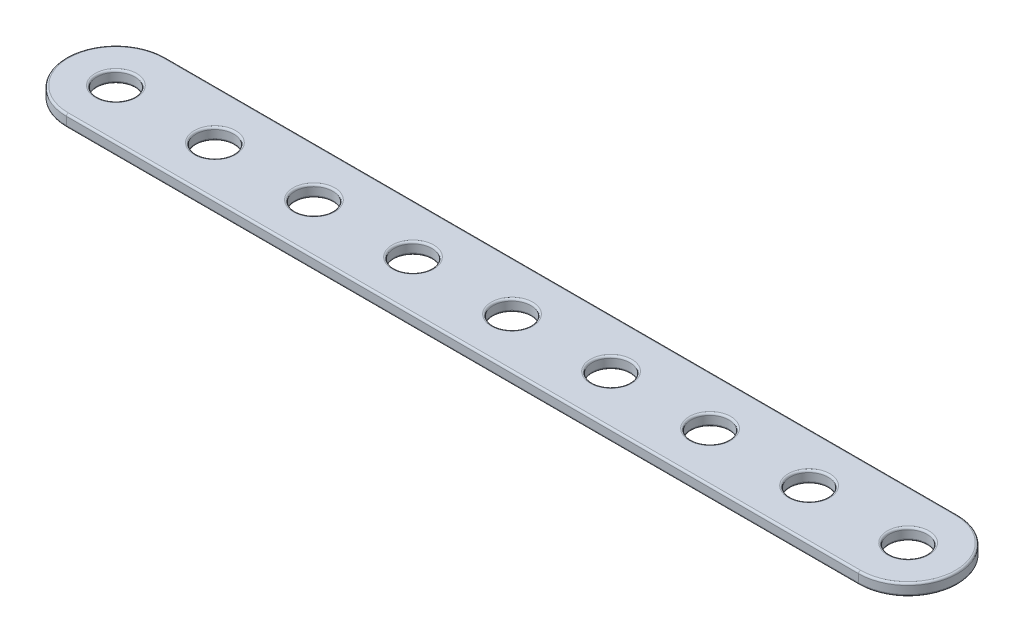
ISO-10303-21;
HEADER;
FILE_DESCRIPTION(('STEP AP214'),'2;1');
FILE_NAME('part.step','',(''),(''),'','','');
FILE_SCHEMA(('AUTOMOTIVE_DESIGN { 1 0 10303 214 1 1 1 1 }'));
ENDSEC;
DATA;
#1=APPLICATION_CONTEXT('core data for automotive mechanical design processes');
#2=APPLICATION_PROTOCOL_DEFINITION('international standard','automotive_design',2000,#1);
#3=PRODUCT_CONTEXT('',#1,'mechanical');
#4=PRODUCT('Part','Part','',(#3));
#5=PRODUCT_RELATED_PRODUCT_CATEGORY('part','',(#4));
#6=PRODUCT_DEFINITION_FORMATION('','',#4);
#7=PRODUCT_DEFINITION_CONTEXT('part definition',#1,'design');
#8=PRODUCT_DEFINITION('design','',#6,#7);
#9=PRODUCT_DEFINITION_SHAPE('','',#8);
#10=(LENGTH_UNIT() NAMED_UNIT(*) SI_UNIT(.MILLI.,.METRE.));
#11=(NAMED_UNIT(*) PLANE_ANGLE_UNIT() SI_UNIT($,.RADIAN.));
#12=(NAMED_UNIT(*) SI_UNIT($,.STERADIAN.) SOLID_ANGLE_UNIT());
#13=UNCERTAINTY_MEASURE_WITH_UNIT(LENGTH_MEASURE(1.E-05),#10,'distance_accuracy_value','');
#14=(GEOMETRIC_REPRESENTATION_CONTEXT(3) GLOBAL_UNCERTAINTY_ASSIGNED_CONTEXT((#13)) GLOBAL_UNIT_ASSIGNED_CONTEXT((#10,
#11,#12)) REPRESENTATION_CONTEXT('',''));
#15=CARTESIAN_POINT('',(0.,0.,0.));
#16=DIRECTION('',(0.,0.,1.));
#17=DIRECTION('',(1.,0.,0.));
#18=AXIS2_PLACEMENT_3D('',#15,#16,#17);
#19=CARTESIAN_POINT('',(0.,1.524,-6.35));
#20=DIRECTION('',(0.,-1.,0.));
#21=DIRECTION('',(0.,0.,-1.));
#22=AXIS2_PLACEMENT_3D('',#19,#20,#21);
#23=CYLINDRICAL_SURFACE('',#22,6.35);
#24=DIRECTION('',(0.,-1.,0.));
#25=VECTOR('',#24,1.);
#26=CARTESIAN_POINT('',(0.,1.524,-12.7));
#27=LINE('',#26,#25);
#28=CARTESIAN_POINT('',(0.,1.27,-12.7));
#29=VERTEX_POINT('',#28);
#30=CARTESIAN_POINT('',(0.,0.254000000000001,-12.7));
#31=VERTEX_POINT('',#30);
#32=EDGE_CURVE('E136',#29,#31,#27,.T.);
#33=ORIENTED_EDGE('',*,*,#32,.T.);
#34=CARTESIAN_POINT('',(0.,0.254,-6.35));
#35=DIRECTION('',(0.,1.,0.));
#36=DIRECTION('',(0.,0.,1.));
#37=AXIS2_PLACEMENT_3D('',#34,#35,#36);
#38=CIRCLE('',#37,6.35);
#39=CARTESIAN_POINT('',(0.,0.254000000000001,0.));
#40=VERTEX_POINT('',#39);
#41=EDGE_CURVE('E184',#31,#40,#38,.T.);
#42=ORIENTED_EDGE('',*,*,#41,.T.);
#43=DIRECTION('',(0.,-1.,0.));
#44=VECTOR('',#43,1.);
#45=CARTESIAN_POINT('',(0.,1.524,0.));
#46=LINE('',#45,#44);
#47=CARTESIAN_POINT('',(0.,1.27,0.));
#48=VERTEX_POINT('',#47);
#49=EDGE_CURVE('E110',#48,#40,#46,.T.);
#50=ORIENTED_EDGE('',*,*,#49,.F.);
#51=CARTESIAN_POINT('',(0.,1.27,-6.35));
#52=DIRECTION('',(0.,1.,0.));
#53=DIRECTION('',(0.,0.,1.));
#54=AXIS2_PLACEMENT_3D('',#51,#52,#53);
#55=CIRCLE('',#54,6.35);
#56=EDGE_CURVE('E182',#48,#29,#55,.F.);
#57=ORIENTED_EDGE('',*,*,#56,.T.);
#58=EDGE_LOOP('',(#33,#42,#50,#57));
#59=FACE_BOUND('',#58,.T.);
#60=ADVANCED_FACE('F26',(#59),#23,.T.);
#61=CARTESIAN_POINT('',(0.,1.524,0.));
#62=DIRECTION('',(0.,0.,-1.));
#63=DIRECTION('',(-1.,0.,0.));
#64=AXIS2_PLACEMENT_3D('',#61,#62,#63);
#65=PLANE('',#64);
#66=ORIENTED_EDGE('',*,*,#49,.T.);
#67=DIRECTION('',(1.,0.,0.));
#68=VECTOR('',#67,1.);
#69=CARTESIAN_POINT('',(0.,0.254,0.));
#70=LINE('',#69,#68);
#71=CARTESIAN_POINT('',(101.6,0.254000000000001,0.));
#72=VERTEX_POINT('',#71);
#73=EDGE_CURVE('E109',#40,#72,#70,.T.);
#74=ORIENTED_EDGE('',*,*,#73,.T.);
#75=DIRECTION('',(0.,-1.,0.));
#76=VECTOR('',#75,1.);
#77=CARTESIAN_POINT('',(101.6,1.524,0.));
#78=LINE('',#77,#76);
#79=CARTESIAN_POINT('',(101.6,1.27,0.));
#80=VERTEX_POINT('',#79);
#81=EDGE_CURVE('E92',#80,#72,#78,.T.);
#82=ORIENTED_EDGE('',*,*,#81,.F.);
#83=DIRECTION('',(1.,0.,0.));
#84=VECTOR('',#83,1.);
#85=CARTESIAN_POINT('',(0.,1.27,0.));
#86=LINE('',#85,#84);
#87=EDGE_CURVE('E106',#80,#48,#86,.F.);
#88=ORIENTED_EDGE('',*,*,#87,.T.);
#89=EDGE_LOOP('',(#66,#74,#82,#88));
#90=FACE_BOUND('',#89,.T.);
#91=ADVANCED_FACE('F105',(#90),#65,.F.);
#92=CARTESIAN_POINT('',(101.6,1.524,-6.35));
#93=DIRECTION('',(0.,-1.,0.));
#94=DIRECTION('',(0.,0.,-1.));
#95=AXIS2_PLACEMENT_3D('',#92,#93,#94);
#96=CYLINDRICAL_SURFACE('',#95,6.35);
#97=ORIENTED_EDGE('',*,*,#81,.T.);
#98=CARTESIAN_POINT('',(101.6,0.254,-6.35));
#99=DIRECTION('',(0.,1.,0.));
#100=DIRECTION('',(0.,0.,1.));
#101=AXIS2_PLACEMENT_3D('',#98,#99,#100);
#102=CIRCLE('',#101,6.35);
#103=CARTESIAN_POINT('',(101.6,0.254000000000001,-12.7));
#104=VERTEX_POINT('',#103);
#105=EDGE_CURVE('E98',#72,#104,#102,.T.);
#106=ORIENTED_EDGE('',*,*,#105,.T.);
#107=DIRECTION('',(0.,-1.,0.));
#108=VECTOR('',#107,1.);
#109=CARTESIAN_POINT('',(101.6,1.524,-12.7));
#110=LINE('',#109,#108);
#111=CARTESIAN_POINT('',(101.6,1.27,-12.7));
#112=VERTEX_POINT('',#111);
#113=EDGE_CURVE('E94',#112,#104,#110,.T.);
#114=ORIENTED_EDGE('',*,*,#113,.F.);
#115=CARTESIAN_POINT('',(101.6,1.27,-6.35));
#116=DIRECTION('',(0.,1.,0.));
#117=DIRECTION('',(0.,0.,1.));
#118=AXIS2_PLACEMENT_3D('',#115,#116,#117);
#119=CIRCLE('',#118,6.35);
#120=EDGE_CURVE('E89',#112,#80,#119,.F.);
#121=ORIENTED_EDGE('',*,*,#120,.T.);
#122=EDGE_LOOP('',(#97,#106,#114,#121));
#123=FACE_BOUND('',#122,.T.);
#124=ADVANCED_FACE('F91',(#123),#96,.T.);
#125=CARTESIAN_POINT('',(0.,1.524,-12.7));
#126=DIRECTION('',(0.,0.,1.));
#127=DIRECTION('',(1.,0.,0.));
#128=AXIS2_PLACEMENT_3D('',#125,#126,#127);
#129=PLANE('',#128);
#130=ORIENTED_EDGE('',*,*,#113,.T.);
#131=DIRECTION('',(-1.,0.,0.));
#132=VECTOR('',#131,1.);
#133=CARTESIAN_POINT('',(0.,0.254,-12.7));
#134=LINE('',#133,#132);
#135=EDGE_CURVE('E180',#104,#31,#134,.T.);
#136=ORIENTED_EDGE('',*,*,#135,.T.);
#137=ORIENTED_EDGE('',*,*,#32,.F.);
#138=DIRECTION('',(-1.,0.,0.));
#139=VECTOR('',#138,1.);
#140=CARTESIAN_POINT('',(101.6,1.27,-12.7));
#141=LINE('',#140,#139);
#142=EDGE_CURVE('E178',#29,#112,#141,.F.);
#143=ORIENTED_EDGE('',*,*,#142,.T.);
#144=EDGE_LOOP('',(#130,#136,#137,#143));
#145=FACE_BOUND('',#144,.T.);
#146=ADVANCED_FACE('F282',(#145),#129,.F.);
#147=CARTESIAN_POINT('',(0.,1.524,-6.35));
#148=DIRECTION('',(0.,1.,0.));
#149=DIRECTION('',(0.,0.,1.));
#150=AXIS2_PLACEMENT_3D('',#147,#148,#149);
#151=PLANE('',#150);
#152=CARTESIAN_POINT('',(101.6,1.524,-6.35));
#153=DIRECTION('',(0.,1.,0.));
#154=DIRECTION('',(0.,0.,1.));
#155=AXIS2_PLACEMENT_3D('',#152,#153,#154);
#156=CIRCLE('',#155,6.096);
#157=CARTESIAN_POINT('',(101.6,1.524,-0.254));
#158=VERTEX_POINT('',#157);
#159=CARTESIAN_POINT('',(101.6,1.524,-12.446));
#160=VERTEX_POINT('',#159);
#161=EDGE_CURVE('E33',#158,#160,#156,.T.);
#162=ORIENTED_EDGE('',*,*,#161,.T.);
#163=DIRECTION('',(-1.,0.,0.));
#164=VECTOR('',#163,1.);
#165=CARTESIAN_POINT('',(0.,1.524,-12.446));
#166=LINE('',#165,#164);
#167=CARTESIAN_POINT('',(0.,1.524,-12.446));
#168=VERTEX_POINT('',#167);
#169=EDGE_CURVE('E11',#160,#168,#166,.T.);
#170=ORIENTED_EDGE('',*,*,#169,.T.);
#171=CARTESIAN_POINT('',(0.,1.524,-6.35));
#172=DIRECTION('',(0.,1.,0.));
#173=DIRECTION('',(0.,0.,1.));
#174=AXIS2_PLACEMENT_3D('',#171,#172,#173);
#175=CIRCLE('',#174,6.096);
#176=CARTESIAN_POINT('',(0.,1.524,-0.254));
#177=VERTEX_POINT('',#176);
#178=EDGE_CURVE('E267',#168,#177,#175,.T.);
#179=ORIENTED_EDGE('',*,*,#178,.T.);
#180=DIRECTION('',(1.,0.,0.));
#181=VECTOR('',#180,1.);
#182=CARTESIAN_POINT('',(101.6,1.524,-0.254));
#183=LINE('',#182,#181);
#184=EDGE_CURVE('E43',#177,#158,#183,.T.);
#185=ORIENTED_EDGE('',*,*,#184,.T.);
#186=EDGE_LOOP('',(#162,#170,#179,#185));
#187=FACE_BOUND('',#186,.T.);
#188=CARTESIAN_POINT('',(0.,1.524,-6.35));
#189=DIRECTION('',(0.,1.,0.));
#190=DIRECTION('',(0.,0.,1.));
#191=AXIS2_PLACEMENT_3D('',#188,#189,#190);
#192=CIRCLE('',#191,2.667);
#193=CARTESIAN_POINT('',(0.,1.524,-3.683));
#194=VERTEX_POINT('',#193);
#195=EDGE_CURVE('E264',#194,#194,#192,.F.);
#196=ORIENTED_EDGE('',*,*,#195,.T.);
#197=EDGE_LOOP('',(#196));
#198=FACE_BOUND('',#197,.T.);
#199=CARTESIAN_POINT('',(12.7,1.524,-6.35));
#200=DIRECTION('',(0.,1.,0.));
#201=DIRECTION('',(0.,0.,1.));
#202=AXIS2_PLACEMENT_3D('',#199,#200,#201);
#203=CIRCLE('',#202,2.667);
#204=CARTESIAN_POINT('',(12.7,1.524,-3.683));
#205=VERTEX_POINT('',#204);
#206=EDGE_CURVE('E261',#205,#205,#203,.F.);
#207=ORIENTED_EDGE('',*,*,#206,.T.);
#208=EDGE_LOOP('',(#207));
#209=FACE_BOUND('',#208,.T.);
#210=CARTESIAN_POINT('',(25.4,1.524,-6.35));
#211=DIRECTION('',(0.,1.,0.));
#212=DIRECTION('',(0.,0.,1.));
#213=AXIS2_PLACEMENT_3D('',#210,#211,#212);
#214=CIRCLE('',#213,2.667);
#215=CARTESIAN_POINT('',(25.4,1.524,-3.683));
#216=VERTEX_POINT('',#215);
#217=EDGE_CURVE('E258',#216,#216,#214,.F.);
#218=ORIENTED_EDGE('',*,*,#217,.T.);
#219=EDGE_LOOP('',(#218));
#220=FACE_BOUND('',#219,.T.);
#221=CARTESIAN_POINT('',(38.1,1.524,-6.35));
#222=DIRECTION('',(0.,1.,0.));
#223=DIRECTION('',(0.,0.,1.));
#224=AXIS2_PLACEMENT_3D('',#221,#222,#223);
#225=CIRCLE('',#224,2.667);
#226=CARTESIAN_POINT('',(38.1,1.524,-3.683));
#227=VERTEX_POINT('',#226);
#228=EDGE_CURVE('E255',#227,#227,#225,.F.);
#229=ORIENTED_EDGE('',*,*,#228,.T.);
#230=EDGE_LOOP('',(#229));
#231=FACE_BOUND('',#230,.T.);
#232=CARTESIAN_POINT('',(50.8,1.524,-6.35));
#233=DIRECTION('',(0.,1.,0.));
#234=DIRECTION('',(0.,0.,1.));
#235=AXIS2_PLACEMENT_3D('',#232,#233,#234);
#236=CIRCLE('',#235,2.667);
#237=CARTESIAN_POINT('',(50.8,1.524,-3.683));
#238=VERTEX_POINT('',#237);
#239=EDGE_CURVE('E252',#238,#238,#236,.F.);
#240=ORIENTED_EDGE('',*,*,#239,.T.);
#241=EDGE_LOOP('',(#240));
#242=FACE_BOUND('',#241,.T.);
#243=CARTESIAN_POINT('',(63.5,1.524,-6.35));
#244=DIRECTION('',(0.,1.,0.));
#245=DIRECTION('',(0.,0.,1.));
#246=AXIS2_PLACEMENT_3D('',#243,#244,#245);
#247=CIRCLE('',#246,2.667);
#248=CARTESIAN_POINT('',(63.5,1.524,-3.683));
#249=VERTEX_POINT('',#248);
#250=EDGE_CURVE('E249',#249,#249,#247,.F.);
#251=ORIENTED_EDGE('',*,*,#250,.T.);
#252=EDGE_LOOP('',(#251));
#253=FACE_BOUND('',#252,.T.);
#254=CARTESIAN_POINT('',(76.2,1.524,-6.35));
#255=DIRECTION('',(0.,1.,0.));
#256=DIRECTION('',(0.,0.,1.));
#257=AXIS2_PLACEMENT_3D('',#254,#255,#256);
#258=CIRCLE('',#257,2.667);
#259=CARTESIAN_POINT('',(76.2,1.524,-3.683));
#260=VERTEX_POINT('',#259);
#261=EDGE_CURVE('E246',#260,#260,#258,.F.);
#262=ORIENTED_EDGE('',*,*,#261,.T.);
#263=EDGE_LOOP('',(#262));
#264=FACE_BOUND('',#263,.T.);
#265=CARTESIAN_POINT('',(88.9,1.524,-6.35));
#266=DIRECTION('',(0.,1.,0.));
#267=DIRECTION('',(0.,0.,1.));
#268=AXIS2_PLACEMENT_3D('',#265,#266,#267);
#269=CIRCLE('',#268,2.667);
#270=CARTESIAN_POINT('',(88.9,1.524,-3.683));
#271=VERTEX_POINT('',#270);
#272=EDGE_CURVE('E243',#271,#271,#269,.F.);
#273=ORIENTED_EDGE('',*,*,#272,.T.);
#274=EDGE_LOOP('',(#273));
#275=FACE_BOUND('',#274,.T.);
#276=CARTESIAN_POINT('',(101.6,1.524,-6.35));
#277=DIRECTION('',(0.,1.,0.));
#278=DIRECTION('',(0.,0.,1.));
#279=AXIS2_PLACEMENT_3D('',#276,#277,#278);
#280=CIRCLE('',#279,2.667);
#281=CARTESIAN_POINT('',(101.6,1.524,-3.683));
#282=VERTEX_POINT('',#281);
#283=EDGE_CURVE('E240',#282,#282,#280,.F.);
#284=ORIENTED_EDGE('',*,*,#283,.T.);
#285=EDGE_LOOP('',(#284));
#286=FACE_BOUND('',#285,.T.);
#287=ADVANCED_FACE('F270',(#187,#198,#209,#220,#231,#242,#253,#264,#275,#286),#151,.T.);
#288=CARTESIAN_POINT('',(0.,0.,-6.35));
#289=DIRECTION('',(0.,1.,0.));
#290=DIRECTION('',(0.,0.,1.));
#291=AXIS2_PLACEMENT_3D('',#288,#289,#290);
#292=PLANE('',#291);
#293=CARTESIAN_POINT('',(101.6,0.,-6.35));
#294=DIRECTION('',(0.,1.,0.));
#295=DIRECTION('',(0.,0.,1.));
#296=AXIS2_PLACEMENT_3D('',#293,#294,#295);
#297=CIRCLE('',#296,6.096);
#298=CARTESIAN_POINT('',(101.6,0.,-12.446));
#299=VERTEX_POINT('',#298);
#300=CARTESIAN_POINT('',(101.6,0.,-0.254));
#301=VERTEX_POINT('',#300);
#302=EDGE_CURVE('E173',#299,#301,#297,.F.);
#303=ORIENTED_EDGE('',*,*,#302,.T.);
#304=DIRECTION('',(1.,0.,0.));
#305=VECTOR('',#304,1.);
#306=CARTESIAN_POINT('',(0.,0.,-0.254));
#307=LINE('',#306,#305);
#308=CARTESIAN_POINT('',(0.,0.,-0.254));
#309=VERTEX_POINT('',#308);
#310=EDGE_CURVE('E99',#301,#309,#307,.F.);
#311=ORIENTED_EDGE('',*,*,#310,.T.);
#312=CARTESIAN_POINT('',(0.,0.,-6.35));
#313=DIRECTION('',(0.,1.,0.));
#314=DIRECTION('',(0.,0.,1.));
#315=AXIS2_PLACEMENT_3D('',#312,#313,#314);
#316=CIRCLE('',#315,6.096);
#317=CARTESIAN_POINT('',(0.,0.,-12.446));
#318=VERTEX_POINT('',#317);
#319=EDGE_CURVE('E169',#309,#318,#316,.F.);
#320=ORIENTED_EDGE('',*,*,#319,.T.);
#321=DIRECTION('',(-1.,0.,0.));
#322=VECTOR('',#321,1.);
#323=CARTESIAN_POINT('',(0.,0.,-12.446));
#324=LINE('',#323,#322);
#325=EDGE_CURVE('E171',#318,#299,#324,.F.);
#326=ORIENTED_EDGE('',*,*,#325,.T.);
#327=EDGE_LOOP('',(#303,#311,#320,#326));
#328=FACE_BOUND('',#327,.T.);
#329=CARTESIAN_POINT('',(0.,0.,-6.35));
#330=DIRECTION('',(0.,1.,0.));
#331=DIRECTION('',(0.,0.,1.));
#332=AXIS2_PLACEMENT_3D('',#329,#330,#331);
#333=CIRCLE('',#332,2.667);
#334=CARTESIAN_POINT('',(0.,0.,-3.683));
#335=VERTEX_POINT('',#334);
#336=EDGE_CURVE('E166',#335,#335,#333,.T.);
#337=ORIENTED_EDGE('',*,*,#336,.T.);
#338=EDGE_LOOP('',(#337));
#339=FACE_BOUND('',#338,.T.);
#340=CARTESIAN_POINT('',(12.7,0.,-6.35));
#341=DIRECTION('',(0.,1.,0.));
#342=DIRECTION('',(0.,0.,1.));
#343=AXIS2_PLACEMENT_3D('',#340,#341,#342);
#344=CIRCLE('',#343,2.667);
#345=CARTESIAN_POINT('',(12.7,0.,-3.683));
#346=VERTEX_POINT('',#345);
#347=EDGE_CURVE('E163',#346,#346,#344,.T.);
#348=ORIENTED_EDGE('',*,*,#347,.T.);
#349=EDGE_LOOP('',(#348));
#350=FACE_BOUND('',#349,.T.);
#351=CARTESIAN_POINT('',(25.4,0.,-6.35));
#352=DIRECTION('',(0.,1.,0.));
#353=DIRECTION('',(0.,0.,1.));
#354=AXIS2_PLACEMENT_3D('',#351,#352,#353);
#355=CIRCLE('',#354,2.667);
#356=CARTESIAN_POINT('',(25.4,0.,-3.683));
#357=VERTEX_POINT('',#356);
#358=EDGE_CURVE('E160',#357,#357,#355,.T.);
#359=ORIENTED_EDGE('',*,*,#358,.T.);
#360=EDGE_LOOP('',(#359));
#361=FACE_BOUND('',#360,.T.);
#362=CARTESIAN_POINT('',(38.1,0.,-6.35));
#363=DIRECTION('',(0.,1.,0.));
#364=DIRECTION('',(0.,0.,1.));
#365=AXIS2_PLACEMENT_3D('',#362,#363,#364);
#366=CIRCLE('',#365,2.667);
#367=CARTESIAN_POINT('',(38.1,0.,-3.683));
#368=VERTEX_POINT('',#367);
#369=EDGE_CURVE('E157',#368,#368,#366,.T.);
#370=ORIENTED_EDGE('',*,*,#369,.T.);
#371=EDGE_LOOP('',(#370));
#372=FACE_BOUND('',#371,.T.);
#373=CARTESIAN_POINT('',(50.8,0.,-6.35));
#374=DIRECTION('',(0.,1.,0.));
#375=DIRECTION('',(0.,0.,1.));
#376=AXIS2_PLACEMENT_3D('',#373,#374,#375);
#377=CIRCLE('',#376,2.667);
#378=CARTESIAN_POINT('',(50.8,0.,-3.683));
#379=VERTEX_POINT('',#378);
#380=EDGE_CURVE('E154',#379,#379,#377,.T.);
#381=ORIENTED_EDGE('',*,*,#380,.T.);
#382=EDGE_LOOP('',(#381));
#383=FACE_BOUND('',#382,.T.);
#384=CARTESIAN_POINT('',(63.5,0.,-6.35));
#385=DIRECTION('',(0.,1.,0.));
#386=DIRECTION('',(0.,0.,1.));
#387=AXIS2_PLACEMENT_3D('',#384,#385,#386);
#388=CIRCLE('',#387,2.667);
#389=CARTESIAN_POINT('',(63.5,0.,-3.683));
#390=VERTEX_POINT('',#389);
#391=EDGE_CURVE('E151',#390,#390,#388,.T.);
#392=ORIENTED_EDGE('',*,*,#391,.T.);
#393=EDGE_LOOP('',(#392));
#394=FACE_BOUND('',#393,.T.);
#395=CARTESIAN_POINT('',(76.2,0.,-6.35));
#396=DIRECTION('',(0.,1.,0.));
#397=DIRECTION('',(0.,0.,1.));
#398=AXIS2_PLACEMENT_3D('',#395,#396,#397);
#399=CIRCLE('',#398,2.667);
#400=CARTESIAN_POINT('',(76.2,0.,-3.683));
#401=VERTEX_POINT('',#400);
#402=EDGE_CURVE('E148',#401,#401,#399,.T.);
#403=ORIENTED_EDGE('',*,*,#402,.T.);
#404=EDGE_LOOP('',(#403));
#405=FACE_BOUND('',#404,.T.);
#406=CARTESIAN_POINT('',(88.9,0.,-6.35));
#407=DIRECTION('',(0.,1.,0.));
#408=DIRECTION('',(0.,0.,1.));
#409=AXIS2_PLACEMENT_3D('',#406,#407,#408);
#410=CIRCLE('',#409,2.667);
#411=CARTESIAN_POINT('',(88.9,0.,-3.683));
#412=VERTEX_POINT('',#411);
#413=EDGE_CURVE('E145',#412,#412,#410,.T.);
#414=ORIENTED_EDGE('',*,*,#413,.T.);
#415=EDGE_LOOP('',(#414));
#416=FACE_BOUND('',#415,.T.);
#417=CARTESIAN_POINT('',(101.6,0.,-6.35));
#418=DIRECTION('',(0.,1.,0.));
#419=DIRECTION('',(0.,0.,1.));
#420=AXIS2_PLACEMENT_3D('',#417,#418,#419);
#421=CIRCLE('',#420,2.667);
#422=CARTESIAN_POINT('',(101.6,0.,-3.683));
#423=VERTEX_POINT('',#422);
#424=EDGE_CURVE('E142',#423,#423,#421,.T.);
#425=ORIENTED_EDGE('',*,*,#424,.T.);
#426=EDGE_LOOP('',(#425));
#427=FACE_BOUND('',#426,.T.);
#428=ADVANCED_FACE('F311',(#328,#339,#350,#361,#372,#383,#394,#405,#416,#427),#292,.F.);
#429=CARTESIAN_POINT('',(0.,0.,-6.35));
#430=DIRECTION('',(0.,1.,0.));
#431=DIRECTION('',(0.,0.,1.));
#432=AXIS2_PLACEMENT_3D('',#429,#430,#431);
#433=CYLINDRICAL_SURFACE('',#432,2.413);
#434=CARTESIAN_POINT('',(0.,0.254,-6.35));
#435=DIRECTION('',(0.,1.,0.));
#436=DIRECTION('',(0.,0.,1.));
#437=AXIS2_PLACEMENT_3D('',#434,#435,#436);
#438=CIRCLE('',#437,2.413);
#439=CARTESIAN_POINT('',(0.,0.254,-3.937));
#440=VERTEX_POINT('',#439);
#441=EDGE_CURVE('E189',#440,#440,#438,.F.);
#442=CARTESIAN_POINT('',(0.,1.27,-6.35));
#443=DIRECTION('',(0.,1.,0.));
#444=DIRECTION('',(0.,0.,1.));
#445=AXIS2_PLACEMENT_3D('',#442,#443,#444);
#446=CIRCLE('',#445,2.413);
#447=CARTESIAN_POINT('',(0.,1.27,-3.937));
#448=VERTEX_POINT('',#447);
#449=EDGE_CURVE('E186',#448,#448,#446,.T.);
#450=CARTESIAN_POINT('',(0.,0.254,-3.937));
#451=CARTESIAN_POINT('',(0.,0.264583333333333,-3.937));
#452=CARTESIAN_POINT('',(0.,0.275166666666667,-3.937));
#453=CARTESIAN_POINT('',(0.,0.296333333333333,-3.937));
#454=CARTESIAN_POINT('',(0.,0.306916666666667,-3.937));
#455=CARTESIAN_POINT('',(0.,0.328083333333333,-3.937));
#456=CARTESIAN_POINT('',(0.,0.338666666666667,-3.937));
#457=CARTESIAN_POINT('',(0.,0.359833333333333,-3.937));
#458=CARTESIAN_POINT('',(0.,0.370416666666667,-3.937));
#459=CARTESIAN_POINT('',(0.,0.391583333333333,-3.937));
#460=CARTESIAN_POINT('',(0.,0.402166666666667,-3.937));
#461=CARTESIAN_POINT('',(0.,0.423333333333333,-3.937));
#462=CARTESIAN_POINT('',(0.,0.433916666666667,-3.937));
#463=CARTESIAN_POINT('',(0.,0.455083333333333,-3.937));
#464=CARTESIAN_POINT('',(0.,0.465666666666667,-3.937));
#465=CARTESIAN_POINT('',(0.,0.486833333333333,-3.937));
#466=CARTESIAN_POINT('',(0.,0.497416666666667,-3.937));
#467=CARTESIAN_POINT('',(0.,0.518583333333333,-3.937));
#468=CARTESIAN_POINT('',(0.,0.529166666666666,-3.937));
#469=CARTESIAN_POINT('',(0.,0.550333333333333,-3.937));
#470=CARTESIAN_POINT('',(0.,0.560916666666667,-3.937));
#471=CARTESIAN_POINT('',(0.,0.582083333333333,-3.937));
#472=CARTESIAN_POINT('',(0.,0.592666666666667,-3.937));
#473=CARTESIAN_POINT('',(0.,0.613833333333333,-3.937));
#474=CARTESIAN_POINT('',(0.,0.624416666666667,-3.937));
#475=CARTESIAN_POINT('',(0.,0.645583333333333,-3.937));
#476=CARTESIAN_POINT('',(0.,0.656166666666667,-3.937));
#477=CARTESIAN_POINT('',(0.,0.677333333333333,-3.937));
#478=CARTESIAN_POINT('',(0.,0.687916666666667,-3.937));
#479=CARTESIAN_POINT('',(0.,0.709083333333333,-3.937));
#480=CARTESIAN_POINT('',(0.,0.719666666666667,-3.937));
#481=CARTESIAN_POINT('',(0.,0.740833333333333,-3.937));
#482=CARTESIAN_POINT('',(0.,0.751416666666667,-3.937));
#483=CARTESIAN_POINT('',(0.,0.772583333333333,-3.937));
#484=CARTESIAN_POINT('',(0.,0.783166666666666,-3.937));
#485=CARTESIAN_POINT('',(0.,0.804333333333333,-3.937));
#486=CARTESIAN_POINT('',(0.,0.814916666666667,-3.937));
#487=CARTESIAN_POINT('',(0.,0.836083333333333,-3.937));
#488=CARTESIAN_POINT('',(0.,0.846666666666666,-3.937));
#489=CARTESIAN_POINT('',(0.,0.867833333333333,-3.937));
#490=CARTESIAN_POINT('',(0.,0.878416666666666,-3.937));
#491=CARTESIAN_POINT('',(0.,0.899583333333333,-3.937));
#492=CARTESIAN_POINT('',(0.,0.910166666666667,-3.937));
#493=CARTESIAN_POINT('',(0.,0.931333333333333,-3.937));
#494=CARTESIAN_POINT('',(0.,0.941916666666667,-3.937));
#495=CARTESIAN_POINT('',(0.,0.963083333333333,-3.937));
#496=CARTESIAN_POINT('',(0.,0.973666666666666,-3.937));
#497=CARTESIAN_POINT('',(0.,0.994833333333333,-3.937));
#498=CARTESIAN_POINT('',(0.,1.00541666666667,-3.937));
#499=CARTESIAN_POINT('',(0.,1.02658333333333,-3.937));
#500=CARTESIAN_POINT('',(0.,1.03716666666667,-3.937));
#501=CARTESIAN_POINT('',(0.,1.05833333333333,-3.937));
#502=CARTESIAN_POINT('',(0.,1.06891666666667,-3.937));
#503=CARTESIAN_POINT('',(0.,1.09008333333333,-3.937));
#504=CARTESIAN_POINT('',(0.,1.10066666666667,-3.937));
#505=CARTESIAN_POINT('',(0.,1.12183333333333,-3.937));
#506=CARTESIAN_POINT('',(0.,1.13241666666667,-3.937));
#507=CARTESIAN_POINT('',(0.,1.15358333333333,-3.937));
#508=CARTESIAN_POINT('',(0.,1.16416666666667,-3.937));
#509=CARTESIAN_POINT('',(0.,1.18533333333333,-3.937));
#510=CARTESIAN_POINT('',(0.,1.19591666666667,-3.937));
#511=CARTESIAN_POINT('',(0.,1.21708333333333,-3.937));
#512=CARTESIAN_POINT('',(0.,1.22766666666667,-3.937));
#513=CARTESIAN_POINT('',(0.,1.24883333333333,-3.937));
#514=CARTESIAN_POINT('',(0.,1.25941666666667,-3.937));
#515=CARTESIAN_POINT('',(0.,1.27,-3.937));
#516=B_SPLINE_CURVE_WITH_KNOTS('',3,(#450,#451,#452,#453,#454,#455,#456,#457,#458,#459,#460,
#461,#462,#463,#464,#465,#466,#467,#468,#469,#470,#471,#472,#473,#474,#475,#476,#477,#478,#479,
#480,#481,#482,#483,#484,#485,#486,#487,#488,#489,#490,#491,#492,#493,#494,#495,#496,#497,#498,
#499,#500,#501,#502,#503,#504,#505,#506,#507,#508,#509,#510,#511,#512,#513,#514,#515),
.UNSPECIFIED.,.F.,.F.,(4,2,2,2,2,2,2,2,2,2,2,2,2,2,2,2,2,2,2,2,2,2,2,2,2,2,2,2,2,2,2,2,4),(0.,
0.03175,0.0635,0.09525,0.127,0.15875,0.1905,0.22225,0.254,0.28575,0.3175,0.34925,0.381,0.41275,
0.4445,0.47625,0.508,0.53975,0.5715,0.60325,0.635,0.66675,0.6985,0.73025,0.762,0.79375,0.8255,
0.85725,0.889,0.92075,0.9525,0.98425,1.016),.UNSPECIFIED.);
#517=EDGE_CURVE('BSEAM314',#440,#448,#516,.T.);
#518=ORIENTED_EDGE('',*,*,#441,.T.);
#519=ORIENTED_EDGE('',*,*,#449,.T.);
#520=ORIENTED_EDGE('',*,*,#517,.T.);
#521=ORIENTED_EDGE('',*,*,#517,.F.);
#522=EDGE_LOOP('',(#518,#520,#519,#521));
#523=FACE_BOUND('',#522,.T.);
#524=ADVANCED_FACE('F314',(#523),#433,.F.);
#525=CARTESIAN_POINT('',(12.7,0.,-6.35));
#526=DIRECTION('',(0.,1.,0.));
#527=DIRECTION('',(0.,0.,1.));
#528=AXIS2_PLACEMENT_3D('',#525,#526,#527);
#529=CYLINDRICAL_SURFACE('',#528,2.413);
#530=CARTESIAN_POINT('',(12.7,0.254,-6.35));
#531=DIRECTION('',(0.,1.,0.));
#532=DIRECTION('',(0.,0.,1.));
#533=AXIS2_PLACEMENT_3D('',#530,#531,#532);
#534=CIRCLE('',#533,2.413);
#535=CARTESIAN_POINT('',(12.7,0.254,-3.937));
#536=VERTEX_POINT('',#535);
#537=EDGE_CURVE('E195',#536,#536,#534,.F.);
#538=CARTESIAN_POINT('',(12.7,1.27,-6.35));
#539=DIRECTION('',(0.,1.,0.));
#540=DIRECTION('',(0.,0.,1.));
#541=AXIS2_PLACEMENT_3D('',#538,#539,#540);
#542=CIRCLE('',#541,2.413);
#543=CARTESIAN_POINT('',(12.7,1.27,-3.937));
#544=VERTEX_POINT('',#543);
#545=EDGE_CURVE('E192',#544,#544,#542,.T.);
#546=CARTESIAN_POINT('',(12.7,0.254,-3.937));
#547=CARTESIAN_POINT('',(12.7,0.264583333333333,-3.937));
#548=CARTESIAN_POINT('',(12.7,0.275166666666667,-3.937));
#549=CARTESIAN_POINT('',(12.7,0.296333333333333,-3.937));
#550=CARTESIAN_POINT('',(12.7,0.306916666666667,-3.937));
#551=CARTESIAN_POINT('',(12.7,0.328083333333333,-3.937));
#552=CARTESIAN_POINT('',(12.7,0.338666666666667,-3.937));
#553=CARTESIAN_POINT('',(12.7,0.359833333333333,-3.937));
#554=CARTESIAN_POINT('',(12.7,0.370416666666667,-3.937));
#555=CARTESIAN_POINT('',(12.7,0.391583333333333,-3.937));
#556=CARTESIAN_POINT('',(12.7,0.402166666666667,-3.937));
#557=CARTESIAN_POINT('',(12.7,0.423333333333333,-3.937));
#558=CARTESIAN_POINT('',(12.7,0.433916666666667,-3.937));
#559=CARTESIAN_POINT('',(12.7,0.455083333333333,-3.937));
#560=CARTESIAN_POINT('',(12.7,0.465666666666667,-3.937));
#561=CARTESIAN_POINT('',(12.7,0.486833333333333,-3.937));
#562=CARTESIAN_POINT('',(12.7,0.497416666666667,-3.937));
#563=CARTESIAN_POINT('',(12.7,0.518583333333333,-3.937));
#564=CARTESIAN_POINT('',(12.7,0.529166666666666,-3.937));
#565=CARTESIAN_POINT('',(12.7,0.550333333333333,-3.937));
#566=CARTESIAN_POINT('',(12.7,0.560916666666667,-3.937));
#567=CARTESIAN_POINT('',(12.7,0.582083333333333,-3.937));
#568=CARTESIAN_POINT('',(12.7,0.592666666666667,-3.937));
#569=CARTESIAN_POINT('',(12.7,0.613833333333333,-3.937));
#570=CARTESIAN_POINT('',(12.7,0.624416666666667,-3.937));
#571=CARTESIAN_POINT('',(12.7,0.645583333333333,-3.937));
#572=CARTESIAN_POINT('',(12.7,0.656166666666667,-3.937));
#573=CARTESIAN_POINT('',(12.7,0.677333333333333,-3.937));
#574=CARTESIAN_POINT('',(12.7,0.687916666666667,-3.937));
#575=CARTESIAN_POINT('',(12.7,0.709083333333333,-3.937));
#576=CARTESIAN_POINT('',(12.7,0.719666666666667,-3.937));
#577=CARTESIAN_POINT('',(12.7,0.740833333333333,-3.937));
#578=CARTESIAN_POINT('',(12.7,0.751416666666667,-3.937));
#579=CARTESIAN_POINT('',(12.7,0.772583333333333,-3.937));
#580=CARTESIAN_POINT('',(12.7,0.783166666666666,-3.937));
#581=CARTESIAN_POINT('',(12.7,0.804333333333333,-3.937));
#582=CARTESIAN_POINT('',(12.7,0.814916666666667,-3.937));
#583=CARTESIAN_POINT('',(12.7,0.836083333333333,-3.937));
#584=CARTESIAN_POINT('',(12.7,0.846666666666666,-3.937));
#585=CARTESIAN_POINT('',(12.7,0.867833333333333,-3.937));
#586=CARTESIAN_POINT('',(12.7,0.878416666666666,-3.937));
#587=CARTESIAN_POINT('',(12.7,0.899583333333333,-3.937));
#588=CARTESIAN_POINT('',(12.7,0.910166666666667,-3.937));
#589=CARTESIAN_POINT('',(12.7,0.931333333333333,-3.937));
#590=CARTESIAN_POINT('',(12.7,0.941916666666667,-3.937));
#591=CARTESIAN_POINT('',(12.7,0.963083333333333,-3.937));
#592=CARTESIAN_POINT('',(12.7,0.973666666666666,-3.937));
#593=CARTESIAN_POINT('',(12.7,0.994833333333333,-3.937));
#594=CARTESIAN_POINT('',(12.7,1.00541666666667,-3.937));
#595=CARTESIAN_POINT('',(12.7,1.02658333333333,-3.937));
#596=CARTESIAN_POINT('',(12.7,1.03716666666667,-3.937));
#597=CARTESIAN_POINT('',(12.7,1.05833333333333,-3.937));
#598=CARTESIAN_POINT('',(12.7,1.06891666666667,-3.937));
#599=CARTESIAN_POINT('',(12.7,1.09008333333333,-3.937));
#600=CARTESIAN_POINT('',(12.7,1.10066666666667,-3.937));
#601=CARTESIAN_POINT('',(12.7,1.12183333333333,-3.937));
#602=CARTESIAN_POINT('',(12.7,1.13241666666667,-3.937));
#603=CARTESIAN_POINT('',(12.7,1.15358333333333,-3.937));
#604=CARTESIAN_POINT('',(12.7,1.16416666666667,-3.937));
#605=CARTESIAN_POINT('',(12.7,1.18533333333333,-3.937));
#606=CARTESIAN_POINT('',(12.7,1.19591666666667,-3.937));
#607=CARTESIAN_POINT('',(12.7,1.21708333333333,-3.937));
#608=CARTESIAN_POINT('',(12.7,1.22766666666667,-3.937));
#609=CARTESIAN_POINT('',(12.7,1.24883333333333,-3.937));
#610=CARTESIAN_POINT('',(12.7,1.25941666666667,-3.937));
#611=CARTESIAN_POINT('',(12.7,1.27,-3.937));
#612=B_SPLINE_CURVE_WITH_KNOTS('',3,(#546,#547,#548,#549,#550,#551,#552,#553,#554,#555,#556,
#557,#558,#559,#560,#561,#562,#563,#564,#565,#566,#567,#568,#569,#570,#571,#572,#573,#574,#575,
#576,#577,#578,#579,#580,#581,#582,#583,#584,#585,#586,#587,#588,#589,#590,#591,#592,#593,#594,
#595,#596,#597,#598,#599,#600,#601,#602,#603,#604,#605,#606,#607,#608,#609,#610,#611),
.UNSPECIFIED.,.F.,.F.,(4,2,2,2,2,2,2,2,2,2,2,2,2,2,2,2,2,2,2,2,2,2,2,2,2,2,2,2,2,2,2,2,4),(0.,
0.03175,0.0635,0.09525,0.127,0.15875,0.1905,0.22225,0.254,0.28575,0.3175,0.34925,0.381,0.41275,
0.4445,0.47625,0.508,0.53975,0.5715,0.60325,0.635,0.66675,0.6985,0.73025,0.762,0.79375,0.8255,
0.85725,0.889,0.92075,0.9525,0.98425,1.016),.UNSPECIFIED.);
#613=EDGE_CURVE('BSEAM318',#536,#544,#612,.T.);
#614=ORIENTED_EDGE('',*,*,#537,.T.);
#615=ORIENTED_EDGE('',*,*,#545,.T.);
#616=ORIENTED_EDGE('',*,*,#613,.T.);
#617=ORIENTED_EDGE('',*,*,#613,.F.);
#618=EDGE_LOOP('',(#614,#616,#615,#617));
#619=FACE_BOUND('',#618,.T.);
#620=ADVANCED_FACE('F318',(#619),#529,.F.);
#621=CARTESIAN_POINT('',(25.4,0.,-6.35));
#622=DIRECTION('',(0.,1.,0.));
#623=DIRECTION('',(0.,0.,1.));
#624=AXIS2_PLACEMENT_3D('',#621,#622,#623);
#625=CYLINDRICAL_SURFACE('',#624,2.413);
#626=CARTESIAN_POINT('',(25.4,0.254,-6.35));
#627=DIRECTION('',(0.,1.,0.));
#628=DIRECTION('',(0.,0.,1.));
#629=AXIS2_PLACEMENT_3D('',#626,#627,#628);
#630=CIRCLE('',#629,2.413);
#631=CARTESIAN_POINT('',(25.4,0.254,-3.937));
#632=VERTEX_POINT('',#631);
#633=EDGE_CURVE('E201',#632,#632,#630,.F.);
#634=CARTESIAN_POINT('',(25.4,1.27,-6.35));
#635=DIRECTION('',(0.,1.,0.));
#636=DIRECTION('',(0.,0.,1.));
#637=AXIS2_PLACEMENT_3D('',#634,#635,#636);
#638=CIRCLE('',#637,2.413);
#639=CARTESIAN_POINT('',(25.4,1.27,-3.937));
#640=VERTEX_POINT('',#639);
#641=EDGE_CURVE('E198',#640,#640,#638,.T.);
#642=CARTESIAN_POINT('',(25.4,0.254,-3.937));
#643=CARTESIAN_POINT('',(25.4,0.264583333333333,-3.937));
#644=CARTESIAN_POINT('',(25.4,0.275166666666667,-3.937));
#645=CARTESIAN_POINT('',(25.4,0.296333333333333,-3.937));
#646=CARTESIAN_POINT('',(25.4,0.306916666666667,-3.937));
#647=CARTESIAN_POINT('',(25.4,0.328083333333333,-3.937));
#648=CARTESIAN_POINT('',(25.4,0.338666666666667,-3.937));
#649=CARTESIAN_POINT('',(25.4,0.359833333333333,-3.937));
#650=CARTESIAN_POINT('',(25.4,0.370416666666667,-3.937));
#651=CARTESIAN_POINT('',(25.4,0.391583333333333,-3.937));
#652=CARTESIAN_POINT('',(25.4,0.402166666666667,-3.937));
#653=CARTESIAN_POINT('',(25.4,0.423333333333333,-3.937));
#654=CARTESIAN_POINT('',(25.4,0.433916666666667,-3.937));
#655=CARTESIAN_POINT('',(25.4,0.455083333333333,-3.937));
#656=CARTESIAN_POINT('',(25.4,0.465666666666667,-3.937));
#657=CARTESIAN_POINT('',(25.4,0.486833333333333,-3.937));
#658=CARTESIAN_POINT('',(25.4,0.497416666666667,-3.937));
#659=CARTESIAN_POINT('',(25.4,0.518583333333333,-3.937));
#660=CARTESIAN_POINT('',(25.4,0.529166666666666,-3.937));
#661=CARTESIAN_POINT('',(25.4,0.550333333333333,-3.937));
#662=CARTESIAN_POINT('',(25.4,0.560916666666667,-3.937));
#663=CARTESIAN_POINT('',(25.4,0.582083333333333,-3.937));
#664=CARTESIAN_POINT('',(25.4,0.592666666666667,-3.937));
#665=CARTESIAN_POINT('',(25.4,0.613833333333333,-3.937));
#666=CARTESIAN_POINT('',(25.4,0.624416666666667,-3.937));
#667=CARTESIAN_POINT('',(25.4,0.645583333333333,-3.937));
#668=CARTESIAN_POINT('',(25.4,0.656166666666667,-3.937));
#669=CARTESIAN_POINT('',(25.4,0.677333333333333,-3.937));
#670=CARTESIAN_POINT('',(25.4,0.687916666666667,-3.937));
#671=CARTESIAN_POINT('',(25.4,0.709083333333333,-3.937));
#672=CARTESIAN_POINT('',(25.4,0.719666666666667,-3.937));
#673=CARTESIAN_POINT('',(25.4,0.740833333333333,-3.937));
#674=CARTESIAN_POINT('',(25.4,0.751416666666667,-3.937));
#675=CARTESIAN_POINT('',(25.4,0.772583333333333,-3.937));
#676=CARTESIAN_POINT('',(25.4,0.783166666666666,-3.937));
#677=CARTESIAN_POINT('',(25.4,0.804333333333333,-3.937));
#678=CARTESIAN_POINT('',(25.4,0.814916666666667,-3.937));
#679=CARTESIAN_POINT('',(25.4,0.836083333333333,-3.937));
#680=CARTESIAN_POINT('',(25.4,0.846666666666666,-3.937));
#681=CARTESIAN_POINT('',(25.4,0.867833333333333,-3.937));
#682=CARTESIAN_POINT('',(25.4,0.878416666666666,-3.937));
#683=CARTESIAN_POINT('',(25.4,0.899583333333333,-3.937));
#684=CARTESIAN_POINT('',(25.4,0.910166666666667,-3.937));
#685=CARTESIAN_POINT('',(25.4,0.931333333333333,-3.937));
#686=CARTESIAN_POINT('',(25.4,0.941916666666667,-3.937));
#687=CARTESIAN_POINT('',(25.4,0.963083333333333,-3.937));
#688=CARTESIAN_POINT('',(25.4,0.973666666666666,-3.937));
#689=CARTESIAN_POINT('',(25.4,0.994833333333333,-3.937));
#690=CARTESIAN_POINT('',(25.4,1.00541666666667,-3.937));
#691=CARTESIAN_POINT('',(25.4,1.02658333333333,-3.937));
#692=CARTESIAN_POINT('',(25.4,1.03716666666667,-3.937));
#693=CARTESIAN_POINT('',(25.4,1.05833333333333,-3.937));
#694=CARTESIAN_POINT('',(25.4,1.06891666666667,-3.937));
#695=CARTESIAN_POINT('',(25.4,1.09008333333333,-3.937));
#696=CARTESIAN_POINT('',(25.4,1.10066666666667,-3.937));
#697=CARTESIAN_POINT('',(25.4,1.12183333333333,-3.937));
#698=CARTESIAN_POINT('',(25.4,1.13241666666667,-3.937));
#699=CARTESIAN_POINT('',(25.4,1.15358333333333,-3.937));
#700=CARTESIAN_POINT('',(25.4,1.16416666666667,-3.937));
#701=CARTESIAN_POINT('',(25.4,1.18533333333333,-3.937));
#702=CARTESIAN_POINT('',(25.4,1.19591666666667,-3.937));
#703=CARTESIAN_POINT('',(25.4,1.21708333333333,-3.937));
#704=CARTESIAN_POINT('',(25.4,1.22766666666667,-3.937));
#705=CARTESIAN_POINT('',(25.4,1.24883333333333,-3.937));
#706=CARTESIAN_POINT('',(25.4,1.25941666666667,-3.937));
#707=CARTESIAN_POINT('',(25.4,1.27,-3.937));
#708=B_SPLINE_CURVE_WITH_KNOTS('',3,(#642,#643,#644,#645,#646,#647,#648,#649,#650,#651,#652,
#653,#654,#655,#656,#657,#658,#659,#660,#661,#662,#663,#664,#665,#666,#667,#668,#669,#670,#671,
#672,#673,#674,#675,#676,#677,#678,#679,#680,#681,#682,#683,#684,#685,#686,#687,#688,#689,#690,
#691,#692,#693,#694,#695,#696,#697,#698,#699,#700,#701,#702,#703,#704,#705,#706,#707),
.UNSPECIFIED.,.F.,.F.,(4,2,2,2,2,2,2,2,2,2,2,2,2,2,2,2,2,2,2,2,2,2,2,2,2,2,2,2,2,2,2,2,4),(0.,
0.03175,0.0635,0.09525,0.127,0.15875,0.1905,0.22225,0.254,0.28575,0.3175,0.34925,0.381,0.41275,
0.4445,0.47625,0.508,0.53975,0.5715,0.60325,0.635,0.66675,0.6985,0.73025,0.762,0.79375,0.8255,
0.85725,0.889,0.92075,0.9525,0.98425,1.016),.UNSPECIFIED.);
#709=EDGE_CURVE('BSEAM322',#632,#640,#708,.T.);
#710=ORIENTED_EDGE('',*,*,#633,.T.);
#711=ORIENTED_EDGE('',*,*,#641,.T.);
#712=ORIENTED_EDGE('',*,*,#709,.T.);
#713=ORIENTED_EDGE('',*,*,#709,.F.);
#714=EDGE_LOOP('',(#710,#712,#711,#713));
#715=FACE_BOUND('',#714,.T.);
#716=ADVANCED_FACE('F322',(#715),#625,.F.);
#717=CARTESIAN_POINT('',(38.1,0.,-6.35));
#718=DIRECTION('',(0.,1.,0.));
#719=DIRECTION('',(0.,0.,1.));
#720=AXIS2_PLACEMENT_3D('',#717,#718,#719);
#721=CYLINDRICAL_SURFACE('',#720,2.413);
#722=CARTESIAN_POINT('',(38.1,0.254,-6.35));
#723=DIRECTION('',(0.,1.,0.));
#724=DIRECTION('',(0.,0.,1.));
#725=AXIS2_PLACEMENT_3D('',#722,#723,#724);
#726=CIRCLE('',#725,2.413);
#727=CARTESIAN_POINT('',(38.1,0.254,-3.937));
#728=VERTEX_POINT('',#727);
#729=EDGE_CURVE('E207',#728,#728,#726,.F.);
#730=CARTESIAN_POINT('',(38.1,1.27,-6.35));
#731=DIRECTION('',(0.,1.,0.));
#732=DIRECTION('',(0.,0.,1.));
#733=AXIS2_PLACEMENT_3D('',#730,#731,#732);
#734=CIRCLE('',#733,2.413);
#735=CARTESIAN_POINT('',(38.1,1.27,-3.937));
#736=VERTEX_POINT('',#735);
#737=EDGE_CURVE('E204',#736,#736,#734,.T.);
#738=CARTESIAN_POINT('',(38.1,0.254,-3.937));
#739=CARTESIAN_POINT('',(38.1,0.264583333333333,-3.937));
#740=CARTESIAN_POINT('',(38.1,0.275166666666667,-3.937));
#741=CARTESIAN_POINT('',(38.1,0.296333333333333,-3.937));
#742=CARTESIAN_POINT('',(38.1,0.306916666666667,-3.937));
#743=CARTESIAN_POINT('',(38.1,0.328083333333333,-3.937));
#744=CARTESIAN_POINT('',(38.1,0.338666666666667,-3.937));
#745=CARTESIAN_POINT('',(38.1,0.359833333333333,-3.937));
#746=CARTESIAN_POINT('',(38.1,0.370416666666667,-3.937));
#747=CARTESIAN_POINT('',(38.1,0.391583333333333,-3.937));
#748=CARTESIAN_POINT('',(38.1,0.402166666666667,-3.937));
#749=CARTESIAN_POINT('',(38.1,0.423333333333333,-3.937));
#750=CARTESIAN_POINT('',(38.1,0.433916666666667,-3.937));
#751=CARTESIAN_POINT('',(38.1,0.455083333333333,-3.937));
#752=CARTESIAN_POINT('',(38.1,0.465666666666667,-3.937));
#753=CARTESIAN_POINT('',(38.1,0.486833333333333,-3.937));
#754=CARTESIAN_POINT('',(38.1,0.497416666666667,-3.937));
#755=CARTESIAN_POINT('',(38.1,0.518583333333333,-3.937));
#756=CARTESIAN_POINT('',(38.1,0.529166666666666,-3.937));
#757=CARTESIAN_POINT('',(38.1,0.550333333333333,-3.937));
#758=CARTESIAN_POINT('',(38.1,0.560916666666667,-3.937));
#759=CARTESIAN_POINT('',(38.1,0.582083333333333,-3.937));
#760=CARTESIAN_POINT('',(38.1,0.592666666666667,-3.937));
#761=CARTESIAN_POINT('',(38.1,0.613833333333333,-3.937));
#762=CARTESIAN_POINT('',(38.1,0.624416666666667,-3.937));
#763=CARTESIAN_POINT('',(38.1,0.645583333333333,-3.937));
#764=CARTESIAN_POINT('',(38.1,0.656166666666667,-3.937));
#765=CARTESIAN_POINT('',(38.1,0.677333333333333,-3.937));
#766=CARTESIAN_POINT('',(38.1,0.687916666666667,-3.937));
#767=CARTESIAN_POINT('',(38.1,0.709083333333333,-3.937));
#768=CARTESIAN_POINT('',(38.1,0.719666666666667,-3.937));
#769=CARTESIAN_POINT('',(38.1,0.740833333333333,-3.937));
#770=CARTESIAN_POINT('',(38.1,0.751416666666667,-3.937));
#771=CARTESIAN_POINT('',(38.1,0.772583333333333,-3.937));
#772=CARTESIAN_POINT('',(38.1,0.783166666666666,-3.937));
#773=CARTESIAN_POINT('',(38.1,0.804333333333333,-3.937));
#774=CARTESIAN_POINT('',(38.1,0.814916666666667,-3.937));
#775=CARTESIAN_POINT('',(38.1,0.836083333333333,-3.937));
#776=CARTESIAN_POINT('',(38.1,0.846666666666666,-3.937));
#777=CARTESIAN_POINT('',(38.1,0.867833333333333,-3.937));
#778=CARTESIAN_POINT('',(38.1,0.878416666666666,-3.937));
#779=CARTESIAN_POINT('',(38.1,0.899583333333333,-3.937));
#780=CARTESIAN_POINT('',(38.1,0.910166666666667,-3.937));
#781=CARTESIAN_POINT('',(38.1,0.931333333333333,-3.937));
#782=CARTESIAN_POINT('',(38.1,0.941916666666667,-3.937));
#783=CARTESIAN_POINT('',(38.1,0.963083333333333,-3.937));
#784=CARTESIAN_POINT('',(38.1,0.973666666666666,-3.937));
#785=CARTESIAN_POINT('',(38.1,0.994833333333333,-3.937));
#786=CARTESIAN_POINT('',(38.1,1.00541666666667,-3.937));
#787=CARTESIAN_POINT('',(38.1,1.02658333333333,-3.937));
#788=CARTESIAN_POINT('',(38.1,1.03716666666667,-3.937));
#789=CARTESIAN_POINT('',(38.1,1.05833333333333,-3.937));
#790=CARTESIAN_POINT('',(38.1,1.06891666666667,-3.937));
#791=CARTESIAN_POINT('',(38.1,1.09008333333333,-3.937));
#792=CARTESIAN_POINT('',(38.1,1.10066666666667,-3.937));
#793=CARTESIAN_POINT('',(38.1,1.12183333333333,-3.937));
#794=CARTESIAN_POINT('',(38.1,1.13241666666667,-3.937));
#795=CARTESIAN_POINT('',(38.1,1.15358333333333,-3.937));
#796=CARTESIAN_POINT('',(38.1,1.16416666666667,-3.937));
#797=CARTESIAN_POINT('',(38.1,1.18533333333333,-3.937));
#798=CARTESIAN_POINT('',(38.1,1.19591666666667,-3.937));
#799=CARTESIAN_POINT('',(38.1,1.21708333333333,-3.937));
#800=CARTESIAN_POINT('',(38.1,1.22766666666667,-3.937));
#801=CARTESIAN_POINT('',(38.1,1.24883333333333,-3.937));
#802=CARTESIAN_POINT('',(38.1,1.25941666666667,-3.937));
#803=CARTESIAN_POINT('',(38.1,1.27,-3.937));
#804=B_SPLINE_CURVE_WITH_KNOTS('',3,(#738,#739,#740,#741,#742,#743,#744,#745,#746,#747,#748,
#749,#750,#751,#752,#753,#754,#755,#756,#757,#758,#759,#760,#761,#762,#763,#764,#765,#766,#767,
#768,#769,#770,#771,#772,#773,#774,#775,#776,#777,#778,#779,#780,#781,#782,#783,#784,#785,#786,
#787,#788,#789,#790,#791,#792,#793,#794,#795,#796,#797,#798,#799,#800,#801,#802,#803),
.UNSPECIFIED.,.F.,.F.,(4,2,2,2,2,2,2,2,2,2,2,2,2,2,2,2,2,2,2,2,2,2,2,2,2,2,2,2,2,2,2,2,4),(0.,
0.03175,0.0635,0.09525,0.127,0.15875,0.1905,0.22225,0.254,0.28575,0.3175,0.34925,0.381,0.41275,
0.4445,0.47625,0.508,0.53975,0.5715,0.60325,0.635,0.66675,0.6985,0.73025,0.762,0.79375,0.8255,
0.85725,0.889,0.92075,0.9525,0.98425,1.016),.UNSPECIFIED.);
#805=EDGE_CURVE('BSEAM326',#728,#736,#804,.T.);
#806=ORIENTED_EDGE('',*,*,#729,.T.);
#807=ORIENTED_EDGE('',*,*,#737,.T.);
#808=ORIENTED_EDGE('',*,*,#805,.T.);
#809=ORIENTED_EDGE('',*,*,#805,.F.);
#810=EDGE_LOOP('',(#806,#808,#807,#809));
#811=FACE_BOUND('',#810,.T.);
#812=ADVANCED_FACE('F326',(#811),#721,.F.);
#813=CARTESIAN_POINT('',(50.8,0.,-6.35));
#814=DIRECTION('',(0.,1.,0.));
#815=DIRECTION('',(0.,0.,1.));
#816=AXIS2_PLACEMENT_3D('',#813,#814,#815);
#817=CYLINDRICAL_SURFACE('',#816,2.413);
#818=CARTESIAN_POINT('',(50.8,0.254,-6.35));
#819=DIRECTION('',(0.,1.,0.));
#820=DIRECTION('',(0.,0.,1.));
#821=AXIS2_PLACEMENT_3D('',#818,#819,#820);
#822=CIRCLE('',#821,2.413);
#823=CARTESIAN_POINT('',(50.8,0.254,-3.937));
#824=VERTEX_POINT('',#823);
#825=EDGE_CURVE('E213',#824,#824,#822,.F.);
#826=CARTESIAN_POINT('',(50.8,1.27,-6.35));
#827=DIRECTION('',(0.,1.,0.));
#828=DIRECTION('',(0.,0.,1.));
#829=AXIS2_PLACEMENT_3D('',#826,#827,#828);
#830=CIRCLE('',#829,2.413);
#831=CARTESIAN_POINT('',(50.8,1.27,-3.937));
#832=VERTEX_POINT('',#831);
#833=EDGE_CURVE('E210',#832,#832,#830,.T.);
#834=CARTESIAN_POINT('',(50.8,0.254,-3.937));
#835=CARTESIAN_POINT('',(50.8,0.264583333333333,-3.937));
#836=CARTESIAN_POINT('',(50.8,0.275166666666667,-3.937));
#837=CARTESIAN_POINT('',(50.8,0.296333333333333,-3.937));
#838=CARTESIAN_POINT('',(50.8,0.306916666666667,-3.937));
#839=CARTESIAN_POINT('',(50.8,0.328083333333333,-3.937));
#840=CARTESIAN_POINT('',(50.8,0.338666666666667,-3.937));
#841=CARTESIAN_POINT('',(50.8,0.359833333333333,-3.937));
#842=CARTESIAN_POINT('',(50.8,0.370416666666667,-3.937));
#843=CARTESIAN_POINT('',(50.8,0.391583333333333,-3.937));
#844=CARTESIAN_POINT('',(50.8,0.402166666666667,-3.937));
#845=CARTESIAN_POINT('',(50.8,0.423333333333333,-3.937));
#846=CARTESIAN_POINT('',(50.8,0.433916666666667,-3.937));
#847=CARTESIAN_POINT('',(50.8,0.455083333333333,-3.937));
#848=CARTESIAN_POINT('',(50.8,0.465666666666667,-3.937));
#849=CARTESIAN_POINT('',(50.8,0.486833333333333,-3.937));
#850=CARTESIAN_POINT('',(50.8,0.497416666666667,-3.937));
#851=CARTESIAN_POINT('',(50.8,0.518583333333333,-3.937));
#852=CARTESIAN_POINT('',(50.8,0.529166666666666,-3.937));
#853=CARTESIAN_POINT('',(50.8,0.550333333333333,-3.937));
#854=CARTESIAN_POINT('',(50.8,0.560916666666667,-3.937));
#855=CARTESIAN_POINT('',(50.8,0.582083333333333,-3.937));
#856=CARTESIAN_POINT('',(50.8,0.592666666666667,-3.937));
#857=CARTESIAN_POINT('',(50.8,0.613833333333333,-3.937));
#858=CARTESIAN_POINT('',(50.8,0.624416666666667,-3.937));
#859=CARTESIAN_POINT('',(50.8,0.645583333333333,-3.937));
#860=CARTESIAN_POINT('',(50.8,0.656166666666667,-3.937));
#861=CARTESIAN_POINT('',(50.8,0.677333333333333,-3.937));
#862=CARTESIAN_POINT('',(50.8,0.687916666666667,-3.937));
#863=CARTESIAN_POINT('',(50.8,0.709083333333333,-3.937));
#864=CARTESIAN_POINT('',(50.8,0.719666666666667,-3.937));
#865=CARTESIAN_POINT('',(50.8,0.740833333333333,-3.937));
#866=CARTESIAN_POINT('',(50.8,0.751416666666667,-3.937));
#867=CARTESIAN_POINT('',(50.8,0.772583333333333,-3.937));
#868=CARTESIAN_POINT('',(50.8,0.783166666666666,-3.937));
#869=CARTESIAN_POINT('',(50.8,0.804333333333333,-3.937));
#870=CARTESIAN_POINT('',(50.8,0.814916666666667,-3.937));
#871=CARTESIAN_POINT('',(50.8,0.836083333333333,-3.937));
#872=CARTESIAN_POINT('',(50.8,0.846666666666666,-3.937));
#873=CARTESIAN_POINT('',(50.8,0.867833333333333,-3.937));
#874=CARTESIAN_POINT('',(50.8,0.878416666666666,-3.937));
#875=CARTESIAN_POINT('',(50.8,0.899583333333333,-3.937));
#876=CARTESIAN_POINT('',(50.8,0.910166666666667,-3.937));
#877=CARTESIAN_POINT('',(50.8,0.931333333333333,-3.937));
#878=CARTESIAN_POINT('',(50.8,0.941916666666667,-3.937));
#879=CARTESIAN_POINT('',(50.8,0.963083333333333,-3.937));
#880=CARTESIAN_POINT('',(50.8,0.973666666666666,-3.937));
#881=CARTESIAN_POINT('',(50.8,0.994833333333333,-3.937));
#882=CARTESIAN_POINT('',(50.8,1.00541666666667,-3.937));
#883=CARTESIAN_POINT('',(50.8,1.02658333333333,-3.937));
#884=CARTESIAN_POINT('',(50.8,1.03716666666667,-3.937));
#885=CARTESIAN_POINT('',(50.8,1.05833333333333,-3.937));
#886=CARTESIAN_POINT('',(50.8,1.06891666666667,-3.937));
#887=CARTESIAN_POINT('',(50.8,1.09008333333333,-3.937));
#888=CARTESIAN_POINT('',(50.8,1.10066666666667,-3.937));
#889=CARTESIAN_POINT('',(50.8,1.12183333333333,-3.937));
#890=CARTESIAN_POINT('',(50.8,1.13241666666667,-3.937));
#891=CARTESIAN_POINT('',(50.8,1.15358333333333,-3.937));
#892=CARTESIAN_POINT('',(50.8,1.16416666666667,-3.937));
#893=CARTESIAN_POINT('',(50.8,1.18533333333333,-3.937));
#894=CARTESIAN_POINT('',(50.8,1.19591666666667,-3.937));
#895=CARTESIAN_POINT('',(50.8,1.21708333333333,-3.937));
#896=CARTESIAN_POINT('',(50.8,1.22766666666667,-3.937));
#897=CARTESIAN_POINT('',(50.8,1.24883333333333,-3.937));
#898=CARTESIAN_POINT('',(50.8,1.25941666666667,-3.937));
#899=CARTESIAN_POINT('',(50.8,1.27,-3.937));
#900=B_SPLINE_CURVE_WITH_KNOTS('',3,(#834,#835,#836,#837,#838,#839,#840,#841,#842,#843,#844,
#845,#846,#847,#848,#849,#850,#851,#852,#853,#854,#855,#856,#857,#858,#859,#860,#861,#862,#863,
#864,#865,#866,#867,#868,#869,#870,#871,#872,#873,#874,#875,#876,#877,#878,#879,#880,#881,#882,
#883,#884,#885,#886,#887,#888,#889,#890,#891,#892,#893,#894,#895,#896,#897,#898,#899),
.UNSPECIFIED.,.F.,.F.,(4,2,2,2,2,2,2,2,2,2,2,2,2,2,2,2,2,2,2,2,2,2,2,2,2,2,2,2,2,2,2,2,4),(0.,
0.03175,0.0635,0.09525,0.127,0.15875,0.1905,0.22225,0.254,0.28575,0.3175,0.34925,0.381,0.41275,
0.4445,0.47625,0.508,0.53975,0.5715,0.60325,0.635,0.66675,0.6985,0.73025,0.762,0.79375,0.8255,
0.85725,0.889,0.92075,0.9525,0.98425,1.016),.UNSPECIFIED.);
#901=EDGE_CURVE('BSEAM330',#824,#832,#900,.T.);
#902=ORIENTED_EDGE('',*,*,#825,.T.);
#903=ORIENTED_EDGE('',*,*,#833,.T.);
#904=ORIENTED_EDGE('',*,*,#901,.T.);
#905=ORIENTED_EDGE('',*,*,#901,.F.);
#906=EDGE_LOOP('',(#902,#904,#903,#905));
#907=FACE_BOUND('',#906,.T.);
#908=ADVANCED_FACE('F330',(#907),#817,.F.);
#909=CARTESIAN_POINT('',(63.5,0.,-6.35));
#910=DIRECTION('',(0.,1.,0.));
#911=DIRECTION('',(0.,0.,1.));
#912=AXIS2_PLACEMENT_3D('',#909,#910,#911);
#913=CYLINDRICAL_SURFACE('',#912,2.413);
#914=CARTESIAN_POINT('',(63.5,0.254,-6.35));
#915=DIRECTION('',(0.,1.,0.));
#916=DIRECTION('',(0.,0.,1.));
#917=AXIS2_PLACEMENT_3D('',#914,#915,#916);
#918=CIRCLE('',#917,2.413);
#919=CARTESIAN_POINT('',(63.5,0.254,-3.937));
#920=VERTEX_POINT('',#919);
#921=EDGE_CURVE('E219',#920,#920,#918,.F.);
#922=CARTESIAN_POINT('',(63.5,1.27,-6.35));
#923=DIRECTION('',(0.,1.,0.));
#924=DIRECTION('',(0.,0.,1.));
#925=AXIS2_PLACEMENT_3D('',#922,#923,#924);
#926=CIRCLE('',#925,2.413);
#927=CARTESIAN_POINT('',(63.5,1.27,-3.937));
#928=VERTEX_POINT('',#927);
#929=EDGE_CURVE('E216',#928,#928,#926,.T.);
#930=CARTESIAN_POINT('',(63.5,0.254,-3.937));
#931=CARTESIAN_POINT('',(63.5,0.264583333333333,-3.937));
#932=CARTESIAN_POINT('',(63.5,0.275166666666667,-3.937));
#933=CARTESIAN_POINT('',(63.5,0.296333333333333,-3.937));
#934=CARTESIAN_POINT('',(63.5,0.306916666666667,-3.937));
#935=CARTESIAN_POINT('',(63.5,0.328083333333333,-3.937));
#936=CARTESIAN_POINT('',(63.5,0.338666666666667,-3.937));
#937=CARTESIAN_POINT('',(63.5,0.359833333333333,-3.937));
#938=CARTESIAN_POINT('',(63.5,0.370416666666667,-3.937));
#939=CARTESIAN_POINT('',(63.5,0.391583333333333,-3.937));
#940=CARTESIAN_POINT('',(63.5,0.402166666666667,-3.937));
#941=CARTESIAN_POINT('',(63.5,0.423333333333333,-3.937));
#942=CARTESIAN_POINT('',(63.5,0.433916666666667,-3.937));
#943=CARTESIAN_POINT('',(63.5,0.455083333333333,-3.937));
#944=CARTESIAN_POINT('',(63.5,0.465666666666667,-3.937));
#945=CARTESIAN_POINT('',(63.5,0.486833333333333,-3.937));
#946=CARTESIAN_POINT('',(63.5,0.497416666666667,-3.937));
#947=CARTESIAN_POINT('',(63.5,0.518583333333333,-3.937));
#948=CARTESIAN_POINT('',(63.5,0.529166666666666,-3.937));
#949=CARTESIAN_POINT('',(63.5,0.550333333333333,-3.937));
#950=CARTESIAN_POINT('',(63.5,0.560916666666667,-3.937));
#951=CARTESIAN_POINT('',(63.5,0.582083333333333,-3.937));
#952=CARTESIAN_POINT('',(63.5,0.592666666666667,-3.937));
#953=CARTESIAN_POINT('',(63.5,0.613833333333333,-3.937));
#954=CARTESIAN_POINT('',(63.5,0.624416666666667,-3.937));
#955=CARTESIAN_POINT('',(63.5,0.645583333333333,-3.937));
#956=CARTESIAN_POINT('',(63.5,0.656166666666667,-3.937));
#957=CARTESIAN_POINT('',(63.5,0.677333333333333,-3.937));
#958=CARTESIAN_POINT('',(63.5,0.687916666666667,-3.937));
#959=CARTESIAN_POINT('',(63.5,0.709083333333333,-3.937));
#960=CARTESIAN_POINT('',(63.5,0.719666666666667,-3.937));
#961=CARTESIAN_POINT('',(63.5,0.740833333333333,-3.937));
#962=CARTESIAN_POINT('',(63.5,0.751416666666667,-3.937));
#963=CARTESIAN_POINT('',(63.5,0.772583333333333,-3.937));
#964=CARTESIAN_POINT('',(63.5,0.783166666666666,-3.937));
#965=CARTESIAN_POINT('',(63.5,0.804333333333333,-3.937));
#966=CARTESIAN_POINT('',(63.5,0.814916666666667,-3.937));
#967=CARTESIAN_POINT('',(63.5,0.836083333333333,-3.937));
#968=CARTESIAN_POINT('',(63.5,0.846666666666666,-3.937));
#969=CARTESIAN_POINT('',(63.5,0.867833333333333,-3.937));
#970=CARTESIAN_POINT('',(63.5,0.878416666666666,-3.937));
#971=CARTESIAN_POINT('',(63.5,0.899583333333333,-3.937));
#972=CARTESIAN_POINT('',(63.5,0.910166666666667,-3.937));
#973=CARTESIAN_POINT('',(63.5,0.931333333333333,-3.937));
#974=CARTESIAN_POINT('',(63.5,0.941916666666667,-3.937));
#975=CARTESIAN_POINT('',(63.5,0.963083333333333,-3.937));
#976=CARTESIAN_POINT('',(63.5,0.973666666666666,-3.937));
#977=CARTESIAN_POINT('',(63.5,0.994833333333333,-3.937));
#978=CARTESIAN_POINT('',(63.5,1.00541666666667,-3.937));
#979=CARTESIAN_POINT('',(63.5,1.02658333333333,-3.937));
#980=CARTESIAN_POINT('',(63.5,1.03716666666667,-3.937));
#981=CARTESIAN_POINT('',(63.5,1.05833333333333,-3.937));
#982=CARTESIAN_POINT('',(63.5,1.06891666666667,-3.937));
#983=CARTESIAN_POINT('',(63.5,1.09008333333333,-3.937));
#984=CARTESIAN_POINT('',(63.5,1.10066666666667,-3.937));
#985=CARTESIAN_POINT('',(63.5,1.12183333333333,-3.937));
#986=CARTESIAN_POINT('',(63.5,1.13241666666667,-3.937));
#987=CARTESIAN_POINT('',(63.5,1.15358333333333,-3.937));
#988=CARTESIAN_POINT('',(63.5,1.16416666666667,-3.937));
#989=CARTESIAN_POINT('',(63.5,1.18533333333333,-3.937));
#990=CARTESIAN_POINT('',(63.5,1.19591666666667,-3.937));
#991=CARTESIAN_POINT('',(63.5,1.21708333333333,-3.937));
#992=CARTESIAN_POINT('',(63.5,1.22766666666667,-3.937));
#993=CARTESIAN_POINT('',(63.5,1.24883333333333,-3.937));
#994=CARTESIAN_POINT('',(63.5,1.25941666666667,-3.937));
#995=CARTESIAN_POINT('',(63.5,1.27,-3.937));
#996=B_SPLINE_CURVE_WITH_KNOTS('',3,(#930,#931,#932,#933,#934,#935,#936,#937,#938,#939,#940,
#941,#942,#943,#944,#945,#946,#947,#948,#949,#950,#951,#952,#953,#954,#955,#956,#957,#958,#959,
#960,#961,#962,#963,#964,#965,#966,#967,#968,#969,#970,#971,#972,#973,#974,#975,#976,#977,#978,
#979,#980,#981,#982,#983,#984,#985,#986,#987,#988,#989,#990,#991,#992,#993,#994,#995),
.UNSPECIFIED.,.F.,.F.,(4,2,2,2,2,2,2,2,2,2,2,2,2,2,2,2,2,2,2,2,2,2,2,2,2,2,2,2,2,2,2,2,4),(0.,
0.03175,0.0635,0.09525,0.127,0.15875,0.1905,0.22225,0.254,0.28575,0.3175,0.34925,0.381,0.41275,
0.4445,0.47625,0.508,0.53975,0.5715,0.60325,0.635,0.66675,0.6985,0.73025,0.762,0.79375,0.8255,
0.85725,0.889,0.92075,0.9525,0.98425,1.016),.UNSPECIFIED.);
#997=EDGE_CURVE('BSEAM334',#920,#928,#996,.T.);
#998=ORIENTED_EDGE('',*,*,#921,.T.);
#999=ORIENTED_EDGE('',*,*,#929,.T.);
#1000=ORIENTED_EDGE('',*,*,#997,.T.);
#1001=ORIENTED_EDGE('',*,*,#997,.F.);
#1002=EDGE_LOOP('',(#998,#1000,#999,#1001));
#1003=FACE_BOUND('',#1002,.T.);
#1004=ADVANCED_FACE('F334',(#1003),#913,.F.);
#1005=CARTESIAN_POINT('',(76.2,0.,-6.35));
#1006=DIRECTION('',(0.,1.,0.));
#1007=DIRECTION('',(0.,0.,1.));
#1008=AXIS2_PLACEMENT_3D('',#1005,#1006,#1007);
#1009=CYLINDRICAL_SURFACE('',#1008,2.413);
#1010=CARTESIAN_POINT('',(76.2,0.254,-6.35));
#1011=DIRECTION('',(0.,1.,0.));
#1012=DIRECTION('',(0.,0.,1.));
#1013=AXIS2_PLACEMENT_3D('',#1010,#1011,#1012);
#1014=CIRCLE('',#1013,2.413);
#1015=CARTESIAN_POINT('',(76.2,0.254,-3.937));
#1016=VERTEX_POINT('',#1015);
#1017=EDGE_CURVE('E225',#1016,#1016,#1014,.F.);
#1018=CARTESIAN_POINT('',(76.2,1.27,-6.35));
#1019=DIRECTION('',(0.,1.,0.));
#1020=DIRECTION('',(0.,0.,1.));
#1021=AXIS2_PLACEMENT_3D('',#1018,#1019,#1020);
#1022=CIRCLE('',#1021,2.413);
#1023=CARTESIAN_POINT('',(76.2,1.27,-3.937));
#1024=VERTEX_POINT('',#1023);
#1025=EDGE_CURVE('E222',#1024,#1024,#1022,.T.);
#1026=CARTESIAN_POINT('',(76.2,0.254,-3.937));
#1027=CARTESIAN_POINT('',(76.2,0.264583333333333,-3.937));
#1028=CARTESIAN_POINT('',(76.2,0.275166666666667,-3.937));
#1029=CARTESIAN_POINT('',(76.2,0.296333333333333,-3.937));
#1030=CARTESIAN_POINT('',(76.2,0.306916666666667,-3.937));
#1031=CARTESIAN_POINT('',(76.2,0.328083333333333,-3.937));
#1032=CARTESIAN_POINT('',(76.2,0.338666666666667,-3.937));
#1033=CARTESIAN_POINT('',(76.2,0.359833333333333,-3.937));
#1034=CARTESIAN_POINT('',(76.2,0.370416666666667,-3.937));
#1035=CARTESIAN_POINT('',(76.2,0.391583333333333,-3.937));
#1036=CARTESIAN_POINT('',(76.2,0.402166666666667,-3.937));
#1037=CARTESIAN_POINT('',(76.2,0.423333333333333,-3.937));
#1038=CARTESIAN_POINT('',(76.2,0.433916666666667,-3.937));
#1039=CARTESIAN_POINT('',(76.2,0.455083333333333,-3.937));
#1040=CARTESIAN_POINT('',(76.2,0.465666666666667,-3.937));
#1041=CARTESIAN_POINT('',(76.2,0.486833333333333,-3.937));
#1042=CARTESIAN_POINT('',(76.2,0.497416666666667,-3.937));
#1043=CARTESIAN_POINT('',(76.2,0.518583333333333,-3.937));
#1044=CARTESIAN_POINT('',(76.2,0.529166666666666,-3.937));
#1045=CARTESIAN_POINT('',(76.2,0.550333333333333,-3.937));
#1046=CARTESIAN_POINT('',(76.2,0.560916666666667,-3.937));
#1047=CARTESIAN_POINT('',(76.2,0.582083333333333,-3.937));
#1048=CARTESIAN_POINT('',(76.2,0.592666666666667,-3.937));
#1049=CARTESIAN_POINT('',(76.2,0.613833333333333,-3.937));
#1050=CARTESIAN_POINT('',(76.2,0.624416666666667,-3.937));
#1051=CARTESIAN_POINT('',(76.2,0.645583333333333,-3.937));
#1052=CARTESIAN_POINT('',(76.2,0.656166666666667,-3.937));
#1053=CARTESIAN_POINT('',(76.2,0.677333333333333,-3.937));
#1054=CARTESIAN_POINT('',(76.2,0.687916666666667,-3.937));
#1055=CARTESIAN_POINT('',(76.2,0.709083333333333,-3.937));
#1056=CARTESIAN_POINT('',(76.2,0.719666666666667,-3.937));
#1057=CARTESIAN_POINT('',(76.2,0.740833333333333,-3.937));
#1058=CARTESIAN_POINT('',(76.2,0.751416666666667,-3.937));
#1059=CARTESIAN_POINT('',(76.2,0.772583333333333,-3.937));
#1060=CARTESIAN_POINT('',(76.2,0.783166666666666,-3.937));
#1061=CARTESIAN_POINT('',(76.2,0.804333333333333,-3.937));
#1062=CARTESIAN_POINT('',(76.2,0.814916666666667,-3.937));
#1063=CARTESIAN_POINT('',(76.2,0.836083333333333,-3.937));
#1064=CARTESIAN_POINT('',(76.2,0.846666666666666,-3.937));
#1065=CARTESIAN_POINT('',(76.2,0.867833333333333,-3.937));
#1066=CARTESIAN_POINT('',(76.2,0.878416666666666,-3.937));
#1067=CARTESIAN_POINT('',(76.2,0.899583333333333,-3.937));
#1068=CARTESIAN_POINT('',(76.2,0.910166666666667,-3.937));
#1069=CARTESIAN_POINT('',(76.2,0.931333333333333,-3.937));
#1070=CARTESIAN_POINT('',(76.2,0.941916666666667,-3.937));
#1071=CARTESIAN_POINT('',(76.2,0.963083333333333,-3.937));
#1072=CARTESIAN_POINT('',(76.2,0.973666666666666,-3.937));
#1073=CARTESIAN_POINT('',(76.2,0.994833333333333,-3.937));
#1074=CARTESIAN_POINT('',(76.2,1.00541666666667,-3.937));
#1075=CARTESIAN_POINT('',(76.2,1.02658333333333,-3.937));
#1076=CARTESIAN_POINT('',(76.2,1.03716666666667,-3.937));
#1077=CARTESIAN_POINT('',(76.2,1.05833333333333,-3.937));
#1078=CARTESIAN_POINT('',(76.2,1.06891666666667,-3.937));
#1079=CARTESIAN_POINT('',(76.2,1.09008333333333,-3.937));
#1080=CARTESIAN_POINT('',(76.2,1.10066666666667,-3.937));
#1081=CARTESIAN_POINT('',(76.2,1.12183333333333,-3.937));
#1082=CARTESIAN_POINT('',(76.2,1.13241666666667,-3.937));
#1083=CARTESIAN_POINT('',(76.2,1.15358333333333,-3.937));
#1084=CARTESIAN_POINT('',(76.2,1.16416666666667,-3.937));
#1085=CARTESIAN_POINT('',(76.2,1.18533333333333,-3.937));
#1086=CARTESIAN_POINT('',(76.2,1.19591666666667,-3.937));
#1087=CARTESIAN_POINT('',(76.2,1.21708333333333,-3.937));
#1088=CARTESIAN_POINT('',(76.2,1.22766666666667,-3.937));
#1089=CARTESIAN_POINT('',(76.2,1.24883333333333,-3.937));
#1090=CARTESIAN_POINT('',(76.2,1.25941666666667,-3.937));
#1091=CARTESIAN_POINT('',(76.2,1.27,-3.937));
#1092=B_SPLINE_CURVE_WITH_KNOTS('',3,(#1026,#1027,#1028,#1029,#1030,#1031,#1032,#1033,#1034,
#1035,#1036,#1037,#1038,#1039,#1040,#1041,#1042,#1043,#1044,#1045,#1046,#1047,#1048,#1049,#1050,
#1051,#1052,#1053,#1054,#1055,#1056,#1057,#1058,#1059,#1060,#1061,#1062,#1063,#1064,#1065,#1066,
#1067,#1068,#1069,#1070,#1071,#1072,#1073,#1074,#1075,#1076,#1077,#1078,#1079,#1080,#1081,#1082,
#1083,#1084,#1085,#1086,#1087,#1088,#1089,#1090,#1091),.UNSPECIFIED.,.F.,.F.,(4,2,2,2,2,2,2,2,2,
2,2,2,2,2,2,2,2,2,2,2,2,2,2,2,2,2,2,2,2,2,2,2,4),(0.,0.03175,0.0635,0.09525,0.127,0.15875,
0.1905,0.22225,0.254,0.28575,0.3175,0.34925,0.381,0.41275,0.4445,0.47625,0.508,0.53975,0.5715,
0.60325,0.635,0.66675,0.6985,0.73025,0.762,0.79375,0.8255,0.85725,0.889,0.92075,0.9525,0.98425,
1.016),.UNSPECIFIED.);
#1093=EDGE_CURVE('BSEAM338',#1016,#1024,#1092,.T.);
#1094=ORIENTED_EDGE('',*,*,#1017,.T.);
#1095=ORIENTED_EDGE('',*,*,#1025,.T.);
#1096=ORIENTED_EDGE('',*,*,#1093,.T.);
#1097=ORIENTED_EDGE('',*,*,#1093,.F.);
#1098=EDGE_LOOP('',(#1094,#1096,#1095,#1097));
#1099=FACE_BOUND('',#1098,.T.);
#1100=ADVANCED_FACE('F338',(#1099),#1009,.F.);
#1101=CARTESIAN_POINT('',(88.9,0.,-6.35));
#1102=DIRECTION('',(0.,1.,0.));
#1103=DIRECTION('',(0.,0.,1.));
#1104=AXIS2_PLACEMENT_3D('',#1101,#1102,#1103);
#1105=CYLINDRICAL_SURFACE('',#1104,2.413);
#1106=CARTESIAN_POINT('',(88.9,0.254,-6.35));
#1107=DIRECTION('',(0.,1.,0.));
#1108=DIRECTION('',(0.,0.,1.));
#1109=AXIS2_PLACEMENT_3D('',#1106,#1107,#1108);
#1110=CIRCLE('',#1109,2.413);
#1111=CARTESIAN_POINT('',(88.9,0.254,-3.937));
#1112=VERTEX_POINT('',#1111);
#1113=EDGE_CURVE('E231',#1112,#1112,#1110,.F.);
#1114=CARTESIAN_POINT('',(88.9,1.27,-6.35));
#1115=DIRECTION('',(0.,1.,0.));
#1116=DIRECTION('',(0.,0.,1.));
#1117=AXIS2_PLACEMENT_3D('',#1114,#1115,#1116);
#1118=CIRCLE('',#1117,2.413);
#1119=CARTESIAN_POINT('',(88.9,1.27,-3.937));
#1120=VERTEX_POINT('',#1119);
#1121=EDGE_CURVE('E228',#1120,#1120,#1118,.T.);
#1122=CARTESIAN_POINT('',(88.9,0.254,-3.937));
#1123=CARTESIAN_POINT('',(88.9,0.264583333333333,-3.937));
#1124=CARTESIAN_POINT('',(88.9,0.275166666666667,-3.937));
#1125=CARTESIAN_POINT('',(88.9,0.296333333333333,-3.937));
#1126=CARTESIAN_POINT('',(88.9,0.306916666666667,-3.937));
#1127=CARTESIAN_POINT('',(88.9,0.328083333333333,-3.937));
#1128=CARTESIAN_POINT('',(88.9,0.338666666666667,-3.937));
#1129=CARTESIAN_POINT('',(88.9,0.359833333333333,-3.937));
#1130=CARTESIAN_POINT('',(88.9,0.370416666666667,-3.937));
#1131=CARTESIAN_POINT('',(88.9,0.391583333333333,-3.937));
#1132=CARTESIAN_POINT('',(88.9,0.402166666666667,-3.937));
#1133=CARTESIAN_POINT('',(88.9,0.423333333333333,-3.937));
#1134=CARTESIAN_POINT('',(88.9,0.433916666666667,-3.937));
#1135=CARTESIAN_POINT('',(88.9,0.455083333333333,-3.937));
#1136=CARTESIAN_POINT('',(88.9,0.465666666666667,-3.937));
#1137=CARTESIAN_POINT('',(88.9,0.486833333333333,-3.937));
#1138=CARTESIAN_POINT('',(88.9,0.497416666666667,-3.937));
#1139=CARTESIAN_POINT('',(88.9,0.518583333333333,-3.937));
#1140=CARTESIAN_POINT('',(88.9,0.529166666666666,-3.937));
#1141=CARTESIAN_POINT('',(88.9,0.550333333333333,-3.937));
#1142=CARTESIAN_POINT('',(88.9,0.560916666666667,-3.937));
#1143=CARTESIAN_POINT('',(88.9,0.582083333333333,-3.937));
#1144=CARTESIAN_POINT('',(88.9,0.592666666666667,-3.937));
#1145=CARTESIAN_POINT('',(88.9,0.613833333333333,-3.937));
#1146=CARTESIAN_POINT('',(88.9,0.624416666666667,-3.937));
#1147=CARTESIAN_POINT('',(88.9,0.645583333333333,-3.937));
#1148=CARTESIAN_POINT('',(88.9,0.656166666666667,-3.937));
#1149=CARTESIAN_POINT('',(88.9,0.677333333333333,-3.937));
#1150=CARTESIAN_POINT('',(88.9,0.687916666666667,-3.937));
#1151=CARTESIAN_POINT('',(88.9,0.709083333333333,-3.937));
#1152=CARTESIAN_POINT('',(88.9,0.719666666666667,-3.937));
#1153=CARTESIAN_POINT('',(88.9,0.740833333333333,-3.937));
#1154=CARTESIAN_POINT('',(88.9,0.751416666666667,-3.937));
#1155=CARTESIAN_POINT('',(88.9,0.772583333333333,-3.937));
#1156=CARTESIAN_POINT('',(88.9,0.783166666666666,-3.937));
#1157=CARTESIAN_POINT('',(88.9,0.804333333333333,-3.937));
#1158=CARTESIAN_POINT('',(88.9,0.814916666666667,-3.937));
#1159=CARTESIAN_POINT('',(88.9,0.836083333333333,-3.937));
#1160=CARTESIAN_POINT('',(88.9,0.846666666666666,-3.937));
#1161=CARTESIAN_POINT('',(88.9,0.867833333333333,-3.937));
#1162=CARTESIAN_POINT('',(88.9,0.878416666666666,-3.937));
#1163=CARTESIAN_POINT('',(88.9,0.899583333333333,-3.937));
#1164=CARTESIAN_POINT('',(88.9,0.910166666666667,-3.937));
#1165=CARTESIAN_POINT('',(88.9,0.931333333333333,-3.937));
#1166=CARTESIAN_POINT('',(88.9,0.941916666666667,-3.937));
#1167=CARTESIAN_POINT('',(88.9,0.963083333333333,-3.937));
#1168=CARTESIAN_POINT('',(88.9,0.973666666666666,-3.937));
#1169=CARTESIAN_POINT('',(88.9,0.994833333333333,-3.937));
#1170=CARTESIAN_POINT('',(88.9,1.00541666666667,-3.937));
#1171=CARTESIAN_POINT('',(88.9,1.02658333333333,-3.937));
#1172=CARTESIAN_POINT('',(88.9,1.03716666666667,-3.937));
#1173=CARTESIAN_POINT('',(88.9,1.05833333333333,-3.937));
#1174=CARTESIAN_POINT('',(88.9,1.06891666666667,-3.937));
#1175=CARTESIAN_POINT('',(88.9,1.09008333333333,-3.937));
#1176=CARTESIAN_POINT('',(88.9,1.10066666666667,-3.937));
#1177=CARTESIAN_POINT('',(88.9,1.12183333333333,-3.937));
#1178=CARTESIAN_POINT('',(88.9,1.13241666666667,-3.937));
#1179=CARTESIAN_POINT('',(88.9,1.15358333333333,-3.937));
#1180=CARTESIAN_POINT('',(88.9,1.16416666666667,-3.937));
#1181=CARTESIAN_POINT('',(88.9,1.18533333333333,-3.937));
#1182=CARTESIAN_POINT('',(88.9,1.19591666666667,-3.937));
#1183=CARTESIAN_POINT('',(88.9,1.21708333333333,-3.937));
#1184=CARTESIAN_POINT('',(88.9,1.22766666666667,-3.937));
#1185=CARTESIAN_POINT('',(88.9,1.24883333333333,-3.937));
#1186=CARTESIAN_POINT('',(88.9,1.25941666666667,-3.937));
#1187=CARTESIAN_POINT('',(88.9,1.27,-3.937));
#1188=B_SPLINE_CURVE_WITH_KNOTS('',3,(#1122,#1123,#1124,#1125,#1126,#1127,#1128,#1129,#1130,
#1131,#1132,#1133,#1134,#1135,#1136,#1137,#1138,#1139,#1140,#1141,#1142,#1143,#1144,#1145,#1146,
#1147,#1148,#1149,#1150,#1151,#1152,#1153,#1154,#1155,#1156,#1157,#1158,#1159,#1160,#1161,#1162,
#1163,#1164,#1165,#1166,#1167,#1168,#1169,#1170,#1171,#1172,#1173,#1174,#1175,#1176,#1177,#1178,
#1179,#1180,#1181,#1182,#1183,#1184,#1185,#1186,#1187),.UNSPECIFIED.,.F.,.F.,(4,2,2,2,2,2,2,2,2,
2,2,2,2,2,2,2,2,2,2,2,2,2,2,2,2,2,2,2,2,2,2,2,4),(0.,0.03175,0.0635,0.09525,0.127,0.15875,
0.1905,0.22225,0.254,0.28575,0.3175,0.34925,0.381,0.41275,0.4445,0.47625,0.508,0.53975,0.5715,
0.60325,0.635,0.66675,0.6985,0.73025,0.762,0.79375,0.8255,0.85725,0.889,0.92075,0.9525,0.98425,
1.016),.UNSPECIFIED.);
#1189=EDGE_CURVE('BSEAM342',#1112,#1120,#1188,.T.);
#1190=ORIENTED_EDGE('',*,*,#1113,.T.);
#1191=ORIENTED_EDGE('',*,*,#1121,.T.);
#1192=ORIENTED_EDGE('',*,*,#1189,.T.);
#1193=ORIENTED_EDGE('',*,*,#1189,.F.);
#1194=EDGE_LOOP('',(#1190,#1192,#1191,#1193));
#1195=FACE_BOUND('',#1194,.T.);
#1196=ADVANCED_FACE('F342',(#1195),#1105,.F.);
#1197=CARTESIAN_POINT('',(101.6,0.,-6.35));
#1198=DIRECTION('',(0.,1.,0.));
#1199=DIRECTION('',(0.,0.,1.));
#1200=AXIS2_PLACEMENT_3D('',#1197,#1198,#1199);
#1201=CYLINDRICAL_SURFACE('',#1200,2.413);
#1202=CARTESIAN_POINT('',(101.6,0.254,-6.35));
#1203=DIRECTION('',(0.,1.,0.));
#1204=DIRECTION('',(0.,0.,1.));
#1205=AXIS2_PLACEMENT_3D('',#1202,#1203,#1204);
#1206=CIRCLE('',#1205,2.413);
#1207=CARTESIAN_POINT('',(101.6,0.254,-3.937));
#1208=VERTEX_POINT('',#1207);
#1209=EDGE_CURVE('E237',#1208,#1208,#1206,.F.);
#1210=CARTESIAN_POINT('',(101.6,1.27,-6.35));
#1211=DIRECTION('',(0.,1.,0.));
#1212=DIRECTION('',(0.,0.,1.));
#1213=AXIS2_PLACEMENT_3D('',#1210,#1211,#1212);
#1214=CIRCLE('',#1213,2.413);
#1215=CARTESIAN_POINT('',(101.6,1.27,-3.937));
#1216=VERTEX_POINT('',#1215);
#1217=EDGE_CURVE('E234',#1216,#1216,#1214,.T.);
#1218=CARTESIAN_POINT('',(101.6,0.254,-3.937));
#1219=CARTESIAN_POINT('',(101.6,0.264583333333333,-3.937));
#1220=CARTESIAN_POINT('',(101.6,0.275166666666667,-3.937));
#1221=CARTESIAN_POINT('',(101.6,0.296333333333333,-3.937));
#1222=CARTESIAN_POINT('',(101.6,0.306916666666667,-3.937));
#1223=CARTESIAN_POINT('',(101.6,0.328083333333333,-3.937));
#1224=CARTESIAN_POINT('',(101.6,0.338666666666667,-3.937));
#1225=CARTESIAN_POINT('',(101.6,0.359833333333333,-3.937));
#1226=CARTESIAN_POINT('',(101.6,0.370416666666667,-3.937));
#1227=CARTESIAN_POINT('',(101.6,0.391583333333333,-3.937));
#1228=CARTESIAN_POINT('',(101.6,0.402166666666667,-3.937));
#1229=CARTESIAN_POINT('',(101.6,0.423333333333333,-3.937));
#1230=CARTESIAN_POINT('',(101.6,0.433916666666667,-3.937));
#1231=CARTESIAN_POINT('',(101.6,0.455083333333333,-3.937));
#1232=CARTESIAN_POINT('',(101.6,0.465666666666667,-3.937));
#1233=CARTESIAN_POINT('',(101.6,0.486833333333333,-3.937));
#1234=CARTESIAN_POINT('',(101.6,0.497416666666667,-3.937));
#1235=CARTESIAN_POINT('',(101.6,0.518583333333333,-3.937));
#1236=CARTESIAN_POINT('',(101.6,0.529166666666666,-3.937));
#1237=CARTESIAN_POINT('',(101.6,0.550333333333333,-3.937));
#1238=CARTESIAN_POINT('',(101.6,0.560916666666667,-3.937));
#1239=CARTESIAN_POINT('',(101.6,0.582083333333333,-3.937));
#1240=CARTESIAN_POINT('',(101.6,0.592666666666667,-3.937));
#1241=CARTESIAN_POINT('',(101.6,0.613833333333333,-3.937));
#1242=CARTESIAN_POINT('',(101.6,0.624416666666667,-3.937));
#1243=CARTESIAN_POINT('',(101.6,0.645583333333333,-3.937));
#1244=CARTESIAN_POINT('',(101.6,0.656166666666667,-3.937));
#1245=CARTESIAN_POINT('',(101.6,0.677333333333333,-3.937));
#1246=CARTESIAN_POINT('',(101.6,0.687916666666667,-3.937));
#1247=CARTESIAN_POINT('',(101.6,0.709083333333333,-3.937));
#1248=CARTESIAN_POINT('',(101.6,0.719666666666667,-3.937));
#1249=CARTESIAN_POINT('',(101.6,0.740833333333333,-3.937));
#1250=CARTESIAN_POINT('',(101.6,0.751416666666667,-3.937));
#1251=CARTESIAN_POINT('',(101.6,0.772583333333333,-3.937));
#1252=CARTESIAN_POINT('',(101.6,0.783166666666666,-3.937));
#1253=CARTESIAN_POINT('',(101.6,0.804333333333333,-3.937));
#1254=CARTESIAN_POINT('',(101.6,0.814916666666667,-3.937));
#1255=CARTESIAN_POINT('',(101.6,0.836083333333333,-3.937));
#1256=CARTESIAN_POINT('',(101.6,0.846666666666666,-3.937));
#1257=CARTESIAN_POINT('',(101.6,0.867833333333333,-3.937));
#1258=CARTESIAN_POINT('',(101.6,0.878416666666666,-3.937));
#1259=CARTESIAN_POINT('',(101.6,0.899583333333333,-3.937));
#1260=CARTESIAN_POINT('',(101.6,0.910166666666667,-3.937));
#1261=CARTESIAN_POINT('',(101.6,0.931333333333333,-3.937));
#1262=CARTESIAN_POINT('',(101.6,0.941916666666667,-3.937));
#1263=CARTESIAN_POINT('',(101.6,0.963083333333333,-3.937));
#1264=CARTESIAN_POINT('',(101.6,0.973666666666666,-3.937));
#1265=CARTESIAN_POINT('',(101.6,0.994833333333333,-3.937));
#1266=CARTESIAN_POINT('',(101.6,1.00541666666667,-3.937));
#1267=CARTESIAN_POINT('',(101.6,1.02658333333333,-3.937));
#1268=CARTESIAN_POINT('',(101.6,1.03716666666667,-3.937));
#1269=CARTESIAN_POINT('',(101.6,1.05833333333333,-3.937));
#1270=CARTESIAN_POINT('',(101.6,1.06891666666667,-3.937));
#1271=CARTESIAN_POINT('',(101.6,1.09008333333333,-3.937));
#1272=CARTESIAN_POINT('',(101.6,1.10066666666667,-3.937));
#1273=CARTESIAN_POINT('',(101.6,1.12183333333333,-3.937));
#1274=CARTESIAN_POINT('',(101.6,1.13241666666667,-3.937));
#1275=CARTESIAN_POINT('',(101.6,1.15358333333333,-3.937));
#1276=CARTESIAN_POINT('',(101.6,1.16416666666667,-3.937));
#1277=CARTESIAN_POINT('',(101.6,1.18533333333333,-3.937));
#1278=CARTESIAN_POINT('',(101.6,1.19591666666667,-3.937));
#1279=CARTESIAN_POINT('',(101.6,1.21708333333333,-3.937));
#1280=CARTESIAN_POINT('',(101.6,1.22766666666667,-3.937));
#1281=CARTESIAN_POINT('',(101.6,1.24883333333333,-3.937));
#1282=CARTESIAN_POINT('',(101.6,1.25941666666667,-3.937));
#1283=CARTESIAN_POINT('',(101.6,1.27,-3.937));
#1284=B_SPLINE_CURVE_WITH_KNOTS('',3,(#1218,#1219,#1220,#1221,#1222,#1223,#1224,#1225,#1226,
#1227,#1228,#1229,#1230,#1231,#1232,#1233,#1234,#1235,#1236,#1237,#1238,#1239,#1240,#1241,#1242,
#1243,#1244,#1245,#1246,#1247,#1248,#1249,#1250,#1251,#1252,#1253,#1254,#1255,#1256,#1257,#1258,
#1259,#1260,#1261,#1262,#1263,#1264,#1265,#1266,#1267,#1268,#1269,#1270,#1271,#1272,#1273,#1274,
#1275,#1276,#1277,#1278,#1279,#1280,#1281,#1282,#1283),.UNSPECIFIED.,.F.,.F.,(4,2,2,2,2,2,2,2,2,
2,2,2,2,2,2,2,2,2,2,2,2,2,2,2,2,2,2,2,2,2,2,2,4),(0.,0.03175,0.0635,0.09525,0.127,0.15875,
0.1905,0.22225,0.254,0.28575,0.3175,0.34925,0.381,0.41275,0.4445,0.47625,0.508,0.53975,0.5715,
0.60325,0.635,0.66675,0.6985,0.73025,0.762,0.79375,0.8255,0.85725,0.889,0.92075,0.9525,0.98425,
1.016),.UNSPECIFIED.);
#1285=EDGE_CURVE('BSEAM346',#1208,#1216,#1284,.T.);
#1286=ORIENTED_EDGE('',*,*,#1209,.T.);
#1287=ORIENTED_EDGE('',*,*,#1217,.T.);
#1288=ORIENTED_EDGE('',*,*,#1285,.T.);
#1289=ORIENTED_EDGE('',*,*,#1285,.F.);
#1290=EDGE_LOOP('',(#1286,#1288,#1287,#1289));
#1291=FACE_BOUND('',#1290,.T.);
#1292=ADVANCED_FACE('F346',(#1291),#1201,.F.);
#1293=CARTESIAN_POINT('',(0.,0.254,-12.446));
#1294=DIRECTION('',(-1.,0.,0.));
#1295=DIRECTION('',(0.,0.,1.));
#1296=AXIS2_PLACEMENT_3D('',#1293,#1294,#1295);
#1297=CYLINDRICAL_SURFACE('',#1296,0.254);
#1298=CARTESIAN_POINT('',(101.6,0.254,-12.446));
#1299=DIRECTION('',(1.,0.,0.));
#1300=DIRECTION('',(0.,0.,-1.));
#1301=AXIS2_PLACEMENT_3D('',#1298,#1299,#1300);
#1302=CIRCLE('',#1301,0.254);
#1303=EDGE_CURVE('E130',#299,#104,#1302,.T.);
#1304=ORIENTED_EDGE('',*,*,#1303,.F.);
#1305=ORIENTED_EDGE('',*,*,#325,.F.);
#1306=CARTESIAN_POINT('',(0.,0.254,-12.446));
#1307=DIRECTION('',(-1.,0.,0.));
#1308=DIRECTION('',(0.,0.,1.));
#1309=AXIS2_PLACEMENT_3D('',#1306,#1307,#1308);
#1310=CIRCLE('',#1309,0.254);
#1311=EDGE_CURVE('E133',#31,#318,#1310,.T.);
#1312=ORIENTED_EDGE('',*,*,#1311,.F.);
#1313=ORIENTED_EDGE('',*,*,#135,.F.);
#1314=EDGE_LOOP('',(#1304,#1305,#1312,#1313));
#1315=FACE_BOUND('',#1314,.T.);
#1316=ADVANCED_FACE('F350',(#1315),#1297,.T.);
#1317=CARTESIAN_POINT('',(0.,0.254,-6.35));
#1318=DIRECTION('',(0.,1.,0.));
#1319=DIRECTION('',(0.,0.,1.));
#1320=AXIS2_PLACEMENT_3D('',#1317,#1318,#1319);
#1321=TOROIDAL_SURFACE('',#1320,6.096,0.254);
#1322=ORIENTED_EDGE('',*,*,#1311,.T.);
#1323=ORIENTED_EDGE('',*,*,#319,.F.);
#1324=CARTESIAN_POINT('',(0.,0.254,-0.254));
#1325=DIRECTION('',(1.,0.,0.));
#1326=DIRECTION('',(0.,0.,-1.));
#1327=AXIS2_PLACEMENT_3D('',#1324,#1325,#1326);
#1328=CIRCLE('',#1327,0.254);
#1329=EDGE_CURVE('E123',#40,#309,#1328,.T.);
#1330=ORIENTED_EDGE('',*,*,#1329,.F.);
#1331=ORIENTED_EDGE('',*,*,#41,.F.);
#1332=EDGE_LOOP('',(#1322,#1323,#1330,#1331));
#1333=FACE_BOUND('',#1332,.T.);
#1334=ADVANCED_FACE('F354',(#1333),#1321,.T.);
#1335=CARTESIAN_POINT('',(101.6,0.254,-6.35));
#1336=DIRECTION('',(0.,1.,0.));
#1337=DIRECTION('',(0.,0.,1.));
#1338=AXIS2_PLACEMENT_3D('',#1335,#1336,#1337);
#1339=TOROIDAL_SURFACE('',#1338,6.096,0.254);
#1340=ORIENTED_EDGE('',*,*,#1303,.T.);
#1341=ORIENTED_EDGE('',*,*,#105,.F.);
#1342=CARTESIAN_POINT('',(101.6,0.254,-0.254));
#1343=DIRECTION('',(-1.,0.,0.));
#1344=DIRECTION('',(0.,0.,1.));
#1345=AXIS2_PLACEMENT_3D('',#1342,#1343,#1344);
#1346=CIRCLE('',#1345,0.254);
#1347=EDGE_CURVE('E121',#301,#72,#1346,.T.);
#1348=ORIENTED_EDGE('',*,*,#1347,.F.);
#1349=ORIENTED_EDGE('',*,*,#302,.F.);
#1350=EDGE_LOOP('',(#1340,#1341,#1348,#1349));
#1351=FACE_BOUND('',#1350,.T.);
#1352=ADVANCED_FACE('F358',(#1351),#1339,.T.);
#1353=CARTESIAN_POINT('',(0.,0.254,-0.254));
#1354=DIRECTION('',(1.,0.,0.));
#1355=DIRECTION('',(0.,0.,-1.));
#1356=AXIS2_PLACEMENT_3D('',#1353,#1354,#1355);
#1357=CYLINDRICAL_SURFACE('',#1356,0.254);
#1358=ORIENTED_EDGE('',*,*,#1329,.T.);
#1359=ORIENTED_EDGE('',*,*,#310,.F.);
#1360=ORIENTED_EDGE('',*,*,#1347,.T.);
#1361=ORIENTED_EDGE('',*,*,#73,.F.);
#1362=EDGE_LOOP('',(#1358,#1359,#1360,#1361));
#1363=FACE_BOUND('',#1362,.T.);
#1364=ADVANCED_FACE('F362',(#1363),#1357,.T.);
#1365=CARTESIAN_POINT('',(0.,0.254,-6.35));
#1366=DIRECTION('',(0.,1.,0.));
#1367=DIRECTION('',(0.,0.,1.));
#1368=AXIS2_PLACEMENT_3D('',#1365,#1366,#1367);
#1369=TOROIDAL_SURFACE('',#1368,2.667,0.254);
#1370=ORIENTED_EDGE('',*,*,#441,.F.);
#1371=EDGE_LOOP('',(#1370));
#1372=FACE_BOUND('',#1371,.T.);
#1373=ORIENTED_EDGE('',*,*,#336,.F.);
#1374=EDGE_LOOP('',(#1373));
#1375=FACE_BOUND('',#1374,.T.);
#1376=ADVANCED_FACE('F366',(#1372,#1375),#1369,.T.);
#1377=CARTESIAN_POINT('',(12.7,0.254,-6.35));
#1378=DIRECTION('',(0.,1.,0.));
#1379=DIRECTION('',(0.,0.,1.));
#1380=AXIS2_PLACEMENT_3D('',#1377,#1378,#1379);
#1381=TOROIDAL_SURFACE('',#1380,2.667,0.254);
#1382=ORIENTED_EDGE('',*,*,#537,.F.);
#1383=EDGE_LOOP('',(#1382));
#1384=FACE_BOUND('',#1383,.T.);
#1385=ORIENTED_EDGE('',*,*,#347,.F.);
#1386=EDGE_LOOP('',(#1385));
#1387=FACE_BOUND('',#1386,.T.);
#1388=ADVANCED_FACE('F370',(#1384,#1387),#1381,.T.);
#1389=CARTESIAN_POINT('',(25.4,0.254,-6.35));
#1390=DIRECTION('',(0.,1.,0.));
#1391=DIRECTION('',(0.,0.,1.));
#1392=AXIS2_PLACEMENT_3D('',#1389,#1390,#1391);
#1393=TOROIDAL_SURFACE('',#1392,2.667,0.254);
#1394=ORIENTED_EDGE('',*,*,#633,.F.);
#1395=EDGE_LOOP('',(#1394));
#1396=FACE_BOUND('',#1395,.T.);
#1397=ORIENTED_EDGE('',*,*,#358,.F.);
#1398=EDGE_LOOP('',(#1397));
#1399=FACE_BOUND('',#1398,.T.);
#1400=ADVANCED_FACE('F374',(#1396,#1399),#1393,.T.);
#1401=CARTESIAN_POINT('',(38.1,0.254,-6.35));
#1402=DIRECTION('',(0.,1.,0.));
#1403=DIRECTION('',(0.,0.,1.));
#1404=AXIS2_PLACEMENT_3D('',#1401,#1402,#1403);
#1405=TOROIDAL_SURFACE('',#1404,2.667,0.254);
#1406=ORIENTED_EDGE('',*,*,#729,.F.);
#1407=EDGE_LOOP('',(#1406));
#1408=FACE_BOUND('',#1407,.T.);
#1409=ORIENTED_EDGE('',*,*,#369,.F.);
#1410=EDGE_LOOP('',(#1409));
#1411=FACE_BOUND('',#1410,.T.);
#1412=ADVANCED_FACE('F378',(#1408,#1411),#1405,.T.);
#1413=CARTESIAN_POINT('',(50.8,0.254,-6.35));
#1414=DIRECTION('',(0.,1.,0.));
#1415=DIRECTION('',(0.,0.,1.));
#1416=AXIS2_PLACEMENT_3D('',#1413,#1414,#1415);
#1417=TOROIDAL_SURFACE('',#1416,2.667,0.254);
#1418=ORIENTED_EDGE('',*,*,#825,.F.);
#1419=EDGE_LOOP('',(#1418));
#1420=FACE_BOUND('',#1419,.T.);
#1421=ORIENTED_EDGE('',*,*,#380,.F.);
#1422=EDGE_LOOP('',(#1421));
#1423=FACE_BOUND('',#1422,.T.);
#1424=ADVANCED_FACE('F382',(#1420,#1423),#1417,.T.);
#1425=CARTESIAN_POINT('',(63.5,0.254,-6.35));
#1426=DIRECTION('',(0.,1.,0.));
#1427=DIRECTION('',(0.,0.,1.));
#1428=AXIS2_PLACEMENT_3D('',#1425,#1426,#1427);
#1429=TOROIDAL_SURFACE('',#1428,2.667,0.254);
#1430=ORIENTED_EDGE('',*,*,#921,.F.);
#1431=EDGE_LOOP('',(#1430));
#1432=FACE_BOUND('',#1431,.T.);
#1433=ORIENTED_EDGE('',*,*,#391,.F.);
#1434=EDGE_LOOP('',(#1433));
#1435=FACE_BOUND('',#1434,.T.);
#1436=ADVANCED_FACE('F386',(#1432,#1435),#1429,.T.);
#1437=CARTESIAN_POINT('',(76.2,0.254,-6.35));
#1438=DIRECTION('',(0.,1.,0.));
#1439=DIRECTION('',(0.,0.,1.));
#1440=AXIS2_PLACEMENT_3D('',#1437,#1438,#1439);
#1441=TOROIDAL_SURFACE('',#1440,2.667,0.254);
#1442=ORIENTED_EDGE('',*,*,#1017,.F.);
#1443=EDGE_LOOP('',(#1442));
#1444=FACE_BOUND('',#1443,.T.);
#1445=ORIENTED_EDGE('',*,*,#402,.F.);
#1446=EDGE_LOOP('',(#1445));
#1447=FACE_BOUND('',#1446,.T.);
#1448=ADVANCED_FACE('F390',(#1444,#1447),#1441,.T.);
#1449=CARTESIAN_POINT('',(88.9,0.254,-6.35));
#1450=DIRECTION('',(0.,1.,0.));
#1451=DIRECTION('',(0.,0.,1.));
#1452=AXIS2_PLACEMENT_3D('',#1449,#1450,#1451);
#1453=TOROIDAL_SURFACE('',#1452,2.667,0.254);
#1454=ORIENTED_EDGE('',*,*,#1113,.F.);
#1455=EDGE_LOOP('',(#1454));
#1456=FACE_BOUND('',#1455,.T.);
#1457=ORIENTED_EDGE('',*,*,#413,.F.);
#1458=EDGE_LOOP('',(#1457));
#1459=FACE_BOUND('',#1458,.T.);
#1460=ADVANCED_FACE('F394',(#1456,#1459),#1453,.T.);
#1461=CARTESIAN_POINT('',(101.6,0.254,-6.35));
#1462=DIRECTION('',(0.,1.,0.));
#1463=DIRECTION('',(0.,0.,1.));
#1464=AXIS2_PLACEMENT_3D('',#1461,#1462,#1463);
#1465=TOROIDAL_SURFACE('',#1464,2.667,0.254);
#1466=ORIENTED_EDGE('',*,*,#1209,.F.);
#1467=EDGE_LOOP('',(#1466));
#1468=FACE_BOUND('',#1467,.T.);
#1469=ORIENTED_EDGE('',*,*,#424,.F.);
#1470=EDGE_LOOP('',(#1469));
#1471=FACE_BOUND('',#1470,.T.);
#1472=ADVANCED_FACE('F398',(#1468,#1471),#1465,.T.);
#1473=CARTESIAN_POINT('',(0.,1.27,-0.254));
#1474=DIRECTION('',(-1.,0.,0.));
#1475=DIRECTION('',(0.,0.,1.));
#1476=AXIS2_PLACEMENT_3D('',#1473,#1474,#1475);
#1477=CYLINDRICAL_SURFACE('',#1476,0.254);
#1478=CARTESIAN_POINT('',(0.,1.27,-0.254));
#1479=DIRECTION('',(-1.,0.,0.));
#1480=DIRECTION('',(0.,0.,1.));
#1481=AXIS2_PLACEMENT_3D('',#1478,#1479,#1480);
#1482=CIRCLE('',#1481,0.254);
#1483=EDGE_CURVE('E117',#48,#177,#1482,.T.);
#1484=ORIENTED_EDGE('',*,*,#1483,.F.);
#1485=ORIENTED_EDGE('',*,*,#87,.F.);
#1486=CARTESIAN_POINT('',(101.6,1.27,-0.254));
#1487=DIRECTION('',(1.,0.,0.));
#1488=DIRECTION('',(0.,0.,-1.));
#1489=AXIS2_PLACEMENT_3D('',#1486,#1487,#1488);
#1490=CIRCLE('',#1489,0.254);
#1491=EDGE_CURVE('E115',#158,#80,#1490,.T.);
#1492=ORIENTED_EDGE('',*,*,#1491,.F.);
#1493=ORIENTED_EDGE('',*,*,#184,.F.);
#1494=EDGE_LOOP('',(#1484,#1485,#1492,#1493));
#1495=FACE_BOUND('',#1494,.T.);
#1496=ADVANCED_FACE('F114',(#1495),#1477,.T.);
#1497=CARTESIAN_POINT('',(101.6,1.27,-6.35));
#1498=DIRECTION('',(0.,1.,0.));
#1499=DIRECTION('',(0.,0.,1.));
#1500=AXIS2_PLACEMENT_3D('',#1497,#1498,#1499);
#1501=TOROIDAL_SURFACE('',#1500,6.096,0.254);
#1502=ORIENTED_EDGE('',*,*,#1491,.T.);
#1503=ORIENTED_EDGE('',*,*,#120,.F.);
#1504=CARTESIAN_POINT('',(101.6,1.27,-12.446));
#1505=DIRECTION('',(-1.,0.,0.));
#1506=DIRECTION('',(0.,0.,1.));
#1507=AXIS2_PLACEMENT_3D('',#1504,#1505,#1506);
#1508=CIRCLE('',#1507,0.254);
#1509=EDGE_CURVE('E125',#160,#112,#1508,.T.);
#1510=ORIENTED_EDGE('',*,*,#1509,.F.);
#1511=ORIENTED_EDGE('',*,*,#161,.F.);
#1512=EDGE_LOOP('',(#1502,#1503,#1510,#1511));
#1513=FACE_BOUND('',#1512,.T.);
#1514=ADVANCED_FACE('F120',(#1513),#1501,.T.);
#1515=CARTESIAN_POINT('',(0.,1.27,-6.35));
#1516=DIRECTION('',(0.,1.,0.));
#1517=DIRECTION('',(0.,0.,1.));
#1518=AXIS2_PLACEMENT_3D('',#1515,#1516,#1517);
#1519=TOROIDAL_SURFACE('',#1518,6.096,0.254);
#1520=ORIENTED_EDGE('',*,*,#1483,.T.);
#1521=ORIENTED_EDGE('',*,*,#178,.F.);
#1522=CARTESIAN_POINT('',(0.,1.27,-12.446));
#1523=DIRECTION('',(1.,0.,0.));
#1524=DIRECTION('',(0.,0.,-1.));
#1525=AXIS2_PLACEMENT_3D('',#1522,#1523,#1524);
#1526=CIRCLE('',#1525,0.254);
#1527=EDGE_CURVE('E276',#29,#168,#1526,.T.);
#1528=ORIENTED_EDGE('',*,*,#1527,.F.);
#1529=ORIENTED_EDGE('',*,*,#56,.F.);
#1530=EDGE_LOOP('',(#1520,#1521,#1528,#1529));
#1531=FACE_BOUND('',#1530,.T.);
#1532=ADVANCED_FACE('F275',(#1531),#1519,.T.);
#1533=CARTESIAN_POINT('',(0.,1.27,-12.446));
#1534=DIRECTION('',(1.,0.,0.));
#1535=DIRECTION('',(0.,0.,-1.));
#1536=AXIS2_PLACEMENT_3D('',#1533,#1534,#1535);
#1537=CYLINDRICAL_SURFACE('',#1536,0.254);
#1538=ORIENTED_EDGE('',*,*,#1509,.T.);
#1539=ORIENTED_EDGE('',*,*,#142,.F.);
#1540=ORIENTED_EDGE('',*,*,#1527,.T.);
#1541=ORIENTED_EDGE('',*,*,#169,.F.);
#1542=EDGE_LOOP('',(#1538,#1539,#1540,#1541));
#1543=FACE_BOUND('',#1542,.T.);
#1544=ADVANCED_FACE('F285',(#1543),#1537,.T.);
#1545=CARTESIAN_POINT('',(0.,1.27,-6.35));
#1546=DIRECTION('',(0.,1.,0.));
#1547=DIRECTION('',(0.,0.,1.));
#1548=AXIS2_PLACEMENT_3D('',#1545,#1546,#1547);
#1549=TOROIDAL_SURFACE('',#1548,2.667,0.254);
#1550=ORIENTED_EDGE('',*,*,#195,.F.);
#1551=EDGE_LOOP('',(#1550));
#1552=FACE_BOUND('',#1551,.T.);
#1553=ORIENTED_EDGE('',*,*,#449,.F.);
#1554=EDGE_LOOP('',(#1553));
#1555=FACE_BOUND('',#1554,.T.);
#1556=ADVANCED_FACE('F288',(#1552,#1555),#1549,.T.);
#1557=CARTESIAN_POINT('',(12.7,1.27,-6.35));
#1558=DIRECTION('',(0.,1.,0.));
#1559=DIRECTION('',(0.,0.,1.));
#1560=AXIS2_PLACEMENT_3D('',#1557,#1558,#1559);
#1561=TOROIDAL_SURFACE('',#1560,2.667,0.254);
#1562=ORIENTED_EDGE('',*,*,#206,.F.);
#1563=EDGE_LOOP('',(#1562));
#1564=FACE_BOUND('',#1563,.T.);
#1565=ORIENTED_EDGE('',*,*,#545,.F.);
#1566=EDGE_LOOP('',(#1565));
#1567=FACE_BOUND('',#1566,.T.);
#1568=ADVANCED_FACE('F294',(#1564,#1567),#1561,.T.);
#1569=CARTESIAN_POINT('',(25.4,1.27,-6.35));
#1570=DIRECTION('',(0.,1.,0.));
#1571=DIRECTION('',(0.,0.,1.));
#1572=AXIS2_PLACEMENT_3D('',#1569,#1570,#1571);
#1573=TOROIDAL_SURFACE('',#1572,2.667,0.254);
#1574=ORIENTED_EDGE('',*,*,#217,.F.);
#1575=EDGE_LOOP('',(#1574));
#1576=FACE_BOUND('',#1575,.T.);
#1577=ORIENTED_EDGE('',*,*,#641,.F.);
#1578=EDGE_LOOP('',(#1577));
#1579=FACE_BOUND('',#1578,.T.);
#1580=ADVANCED_FACE('F427',(#1576,#1579),#1573,.T.);
#1581=CARTESIAN_POINT('',(38.1,1.27,-6.35));
#1582=DIRECTION('',(0.,1.,0.));
#1583=DIRECTION('',(0.,0.,1.));
#1584=AXIS2_PLACEMENT_3D('',#1581,#1582,#1583);
#1585=TOROIDAL_SURFACE('',#1584,2.667,0.254);
#1586=ORIENTED_EDGE('',*,*,#228,.F.);
#1587=EDGE_LOOP('',(#1586));
#1588=FACE_BOUND('',#1587,.T.);
#1589=ORIENTED_EDGE('',*,*,#737,.F.);
#1590=EDGE_LOOP('',(#1589));
#1591=FACE_BOUND('',#1590,.T.);
#1592=ADVANCED_FACE('F435',(#1588,#1591),#1585,.T.);
#1593=CARTESIAN_POINT('',(50.8,1.27,-6.35));
#1594=DIRECTION('',(0.,1.,0.));
#1595=DIRECTION('',(0.,0.,1.));
#1596=AXIS2_PLACEMENT_3D('',#1593,#1594,#1595);
#1597=TOROIDAL_SURFACE('',#1596,2.667,0.254);
#1598=ORIENTED_EDGE('',*,*,#239,.F.);
#1599=EDGE_LOOP('',(#1598));
#1600=FACE_BOUND('',#1599,.T.);
#1601=ORIENTED_EDGE('',*,*,#833,.F.);
#1602=EDGE_LOOP('',(#1601));
#1603=FACE_BOUND('',#1602,.T.);
#1604=ADVANCED_FACE('F443',(#1600,#1603),#1597,.T.);
#1605=CARTESIAN_POINT('',(63.5,1.27,-6.35));
#1606=DIRECTION('',(0.,1.,0.));
#1607=DIRECTION('',(0.,0.,1.));
#1608=AXIS2_PLACEMENT_3D('',#1605,#1606,#1607);
#1609=TOROIDAL_SURFACE('',#1608,2.667,0.254);
#1610=ORIENTED_EDGE('',*,*,#250,.F.);
#1611=EDGE_LOOP('',(#1610));
#1612=FACE_BOUND('',#1611,.T.);
#1613=ORIENTED_EDGE('',*,*,#929,.F.);
#1614=EDGE_LOOP('',(#1613));
#1615=FACE_BOUND('',#1614,.T.);
#1616=ADVANCED_FACE('F451',(#1612,#1615),#1609,.T.);
#1617=CARTESIAN_POINT('',(76.2,1.27,-6.35));
#1618=DIRECTION('',(0.,1.,0.));
#1619=DIRECTION('',(0.,0.,1.));
#1620=AXIS2_PLACEMENT_3D('',#1617,#1618,#1619);
#1621=TOROIDAL_SURFACE('',#1620,2.667,0.254);
#1622=ORIENTED_EDGE('',*,*,#261,.F.);
#1623=EDGE_LOOP('',(#1622));
#1624=FACE_BOUND('',#1623,.T.);
#1625=ORIENTED_EDGE('',*,*,#1025,.F.);
#1626=EDGE_LOOP('',(#1625));
#1627=FACE_BOUND('',#1626,.T.);
#1628=ADVANCED_FACE('F459',(#1624,#1627),#1621,.T.);
#1629=CARTESIAN_POINT('',(88.9,1.27,-6.35));
#1630=DIRECTION('',(0.,1.,0.));
#1631=DIRECTION('',(0.,0.,1.));
#1632=AXIS2_PLACEMENT_3D('',#1629,#1630,#1631);
#1633=TOROIDAL_SURFACE('',#1632,2.667,0.254);
#1634=ORIENTED_EDGE('',*,*,#272,.F.);
#1635=EDGE_LOOP('',(#1634));
#1636=FACE_BOUND('',#1635,.T.);
#1637=ORIENTED_EDGE('',*,*,#1121,.F.);
#1638=EDGE_LOOP('',(#1637));
#1639=FACE_BOUND('',#1638,.T.);
#1640=ADVANCED_FACE('F467',(#1636,#1639),#1633,.T.);
#1641=CARTESIAN_POINT('',(101.6,1.27,-6.35));
#1642=DIRECTION('',(0.,1.,0.));
#1643=DIRECTION('',(0.,0.,1.));
#1644=AXIS2_PLACEMENT_3D('',#1641,#1642,#1643);
#1645=TOROIDAL_SURFACE('',#1644,2.667,0.254);
#1646=ORIENTED_EDGE('',*,*,#283,.F.);
#1647=EDGE_LOOP('',(#1646));
#1648=FACE_BOUND('',#1647,.T.);
#1649=ORIENTED_EDGE('',*,*,#1217,.F.);
#1650=EDGE_LOOP('',(#1649));
#1651=FACE_BOUND('',#1650,.T.);
#1652=ADVANCED_FACE('F475',(#1648,#1651),#1645,.T.);
#1653=CLOSED_SHELL('',(#60,#91,#124,#146,#287,#428,#524,#620,#716,#812,#908,#1004,#1100,#1196,
#1292,#1316,#1334,#1352,#1364,#1376,#1388,#1400,#1412,#1424,#1436,#1448,#1460,#1472,#1496,#1514,
#1532,#1544,#1556,#1568,#1580,#1592,#1604,#1616,#1628,#1640,#1652));
#1654=MANIFOLD_SOLID_BREP('B2',#1653);
#1655=ADVANCED_BREP_SHAPE_REPRESENTATION('',(#18,#1654),#14);
#1656=SHAPE_DEFINITION_REPRESENTATION(#9,#1655);
ENDSEC;
END-ISO-10303-21;
